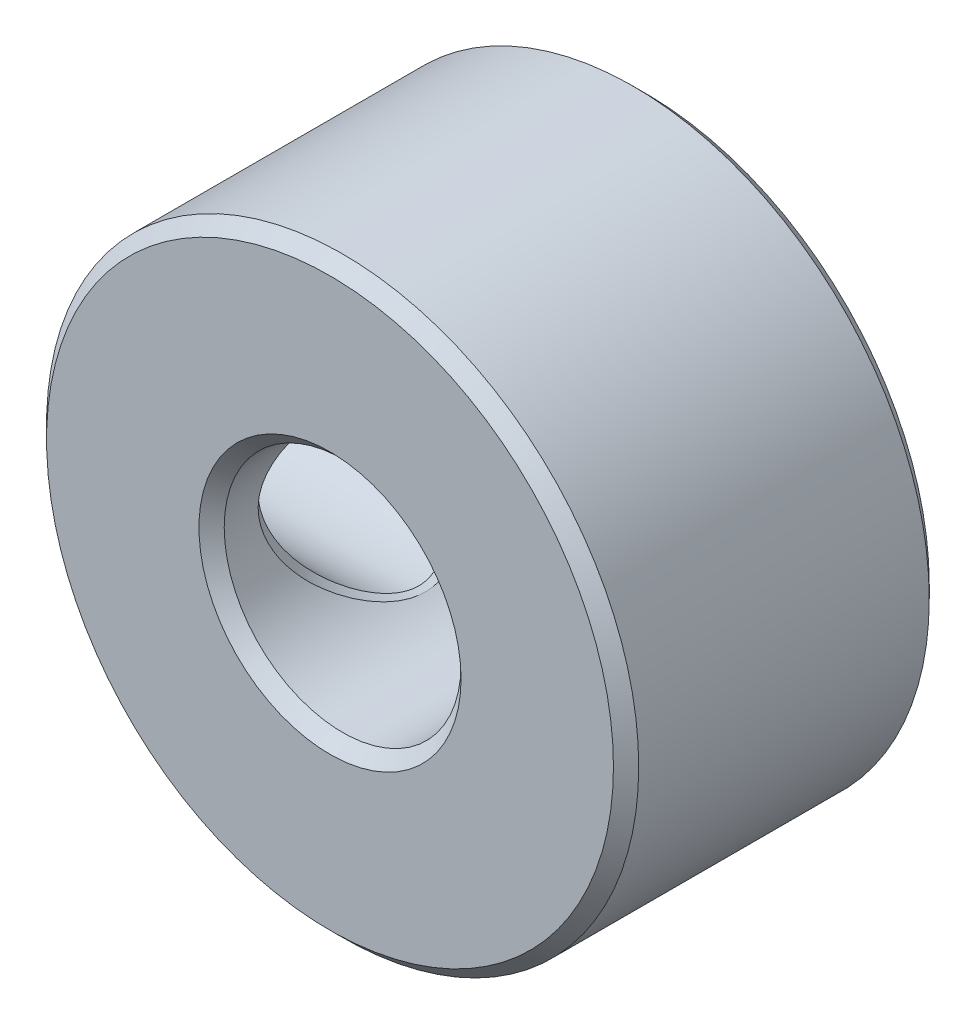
ISO-10303-21;
HEADER;
FILE_DESCRIPTION(('STEP AP214'),'2;1');
FILE_NAME('part.step','',(''),(''),'','','');
FILE_SCHEMA(('AUTOMOTIVE_DESIGN { 1 0 10303 214 1 1 1 1 }'));
ENDSEC;
DATA;
#1=APPLICATION_CONTEXT('core data for automotive mechanical design processes');
#2=APPLICATION_PROTOCOL_DEFINITION('international standard','automotive_design',2000,#1);
#3=PRODUCT_CONTEXT('',#1,'mechanical');
#4=PRODUCT('Part','Part','',(#3));
#5=PRODUCT_RELATED_PRODUCT_CATEGORY('part','',(#4));
#6=PRODUCT_DEFINITION_FORMATION('','',#4);
#7=PRODUCT_DEFINITION_CONTEXT('part definition',#1,'design');
#8=PRODUCT_DEFINITION('design','',#6,#7);
#9=PRODUCT_DEFINITION_SHAPE('','',#8);
#10=(LENGTH_UNIT() NAMED_UNIT(*) SI_UNIT(.MILLI.,.METRE.));
#11=(NAMED_UNIT(*) PLANE_ANGLE_UNIT() SI_UNIT($,.RADIAN.));
#12=(NAMED_UNIT(*) SI_UNIT($,.STERADIAN.) SOLID_ANGLE_UNIT());
#13=UNCERTAINTY_MEASURE_WITH_UNIT(LENGTH_MEASURE(1.E-05),#10,'distance_accuracy_value','');
#14=(GEOMETRIC_REPRESENTATION_CONTEXT(3) GLOBAL_UNCERTAINTY_ASSIGNED_CONTEXT((#13)) GLOBAL_UNIT_ASSIGNED_CONTEXT((#10,
#11,#12)) REPRESENTATION_CONTEXT('',''));
#15=CARTESIAN_POINT('',(0.,0.,0.));
#16=DIRECTION('',(0.,0.,1.));
#17=DIRECTION('',(1.,0.,0.));
#18=AXIS2_PLACEMENT_3D('',#15,#16,#17);
#19=CARTESIAN_POINT('',(0.,0.,3.175));
#20=DIRECTION('',(0.,0.,1.));
#21=DIRECTION('',(1.,0.,0.));
#22=AXIS2_PLACEMENT_3D('',#19,#20,#21);
#23=PLANE('',#22);
#24=CARTESIAN_POINT('',(0.,0.,3.175));
#25=DIRECTION('',(0.,0.,1.));
#26=DIRECTION('',(1.,0.,0.));
#27=AXIS2_PLACEMENT_3D('',#24,#25,#26);
#28=CIRCLE('',#27,5.699125);
#29=CARTESIAN_POINT('',(5.699125,0.,3.175));
#30=VERTEX_POINT('',#29);
#31=EDGE_CURVE('E91',#30,#30,#28,.T.);
#32=ORIENTED_EDGE('',*,*,#31,.T.);
#33=EDGE_LOOP('',(#32));
#34=FACE_BOUND('',#33,.T.);
#35=CARTESIAN_POINT('',(0.,0.,3.175));
#36=DIRECTION('',(0.,0.,1.));
#37=DIRECTION('',(1.,0.,0.));
#38=AXIS2_PLACEMENT_3D('',#35,#36,#37);
#39=CIRCLE('',#38,2.63525);
#40=CARTESIAN_POINT('',(2.63525,0.,3.175));
#41=VERTEX_POINT('',#40);
#42=EDGE_CURVE('E94',#41,#41,#39,.F.);
#43=ORIENTED_EDGE('',*,*,#42,.T.);
#44=EDGE_LOOP('',(#43));
#45=FACE_BOUND('',#44,.T.);
#46=ADVANCED_FACE('F30',(#34,#45),#23,.T.);
#47=CARTESIAN_POINT('',(0.,0.,-3.175));
#48=DIRECTION('',(0.,0.,1.));
#49=DIRECTION('',(1.,0.,0.));
#50=AXIS2_PLACEMENT_3D('',#47,#48,#49);
#51=PLANE('',#50);
#52=CARTESIAN_POINT('',(0.,0.,-3.175));
#53=DIRECTION('',(0.,0.,1.));
#54=DIRECTION('',(1.,0.,0.));
#55=AXIS2_PLACEMENT_3D('',#52,#53,#54);
#56=CIRCLE('',#55,5.699125);
#57=CARTESIAN_POINT('',(5.699125,0.,-3.175));
#58=VERTEX_POINT('',#57);
#59=EDGE_CURVE('E97',#58,#58,#56,.F.);
#60=ORIENTED_EDGE('',*,*,#59,.T.);
#61=EDGE_LOOP('',(#60));
#62=FACE_BOUND('',#61,.T.);
#63=CARTESIAN_POINT('',(0.,0.,-3.175));
#64=DIRECTION('',(0.,0.,1.));
#65=DIRECTION('',(1.,0.,0.));
#66=AXIS2_PLACEMENT_3D('',#63,#64,#65);
#67=CIRCLE('',#66,2.63525);
#68=CARTESIAN_POINT('',(2.63525,0.,-3.175));
#69=VERTEX_POINT('',#68);
#70=EDGE_CURVE('E100',#69,#69,#67,.T.);
#71=ORIENTED_EDGE('',*,*,#70,.T.);
#72=EDGE_LOOP('',(#71));
#73=FACE_BOUND('',#72,.T.);
#74=ADVANCED_FACE('F78',(#62,#73),#51,.F.);
#75=CARTESIAN_POINT('',(0.,0.,3.175));
#76=DIRECTION('',(0.,0.,-1.));
#77=DIRECTION('',(-1.,0.,0.));
#78=AXIS2_PLACEMENT_3D('',#75,#76,#77);
#79=CYLINDRICAL_SURFACE('',#78,5.953125);
#80=CARTESIAN_POINT('',(0.,0.,-2.921));
#81=DIRECTION('',(0.,0.,1.));
#82=DIRECTION('',(1.,0.,0.));
#83=AXIS2_PLACEMENT_3D('',#80,#81,#82);
#84=CIRCLE('',#83,5.953125);
#85=CARTESIAN_POINT('',(5.953125,0.,-2.921));
#86=VERTEX_POINT('',#85);
#87=EDGE_CURVE('E103',#86,#86,#84,.T.);
#88=ORIENTED_EDGE('',*,*,#87,.T.);
#89=EDGE_LOOP('',(#88));
#90=FACE_BOUND('',#89,.T.);
#91=CARTESIAN_POINT('',(0.,0.,2.921));
#92=DIRECTION('',(0.,0.,1.));
#93=DIRECTION('',(1.,0.,0.));
#94=AXIS2_PLACEMENT_3D('',#91,#92,#93);
#95=CIRCLE('',#94,5.953125);
#96=CARTESIAN_POINT('',(5.953125,0.,2.921));
#97=VERTEX_POINT('',#96);
#98=EDGE_CURVE('E106',#97,#97,#95,.F.);
#99=ORIENTED_EDGE('',*,*,#98,.T.);
#100=EDGE_LOOP('',(#99));
#101=FACE_BOUND('',#100,.T.);
#102=CARTESIAN_POINT('',(-5.953125,0.,2.2383749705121));
#103=CARTESIAN_POINT('',(-5.95311577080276,0.0387457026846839,2.23834722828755));
#104=CARTESIAN_POINT('',(-5.95268471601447,0.07748844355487,2.23736117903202));
#105=CARTESIAN_POINT('',(-5.95102066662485,0.154766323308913,2.23350635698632));
#106=CARTESIAN_POINT('',(-5.94978967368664,0.193301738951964,2.230642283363));
#107=CARTESIAN_POINT('',(-5.94657001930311,0.270085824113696,2.22307193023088));
#108=CARTESIAN_POINT('',(-5.94458277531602,0.308334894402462,2.21836909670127));
#109=CARTESIAN_POINT('',(-5.93989543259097,0.384468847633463,2.20716284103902));
#110=CARTESIAN_POINT('',(-5.9371963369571,0.422354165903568,2.20066195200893));
#111=CARTESIAN_POINT('',(-5.93112974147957,0.497682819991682,2.1859004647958));
#112=CARTESIAN_POINT('',(-5.92776297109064,0.535126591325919,2.17764178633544));
#113=CARTESIAN_POINT('',(-5.92040539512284,0.609494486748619,2.1594054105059));
#114=CARTESIAN_POINT('',(-5.91641515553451,0.646419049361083,2.14942927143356));
#115=CARTESIAN_POINT('',(-5.90785489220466,0.719670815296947,2.12779838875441));
#116=CARTESIAN_POINT('',(-5.9032853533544,0.75599848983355,2.11614504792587));
#117=CARTESIAN_POINT('',(-5.89361066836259,0.827978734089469,2.0911999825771));
#118=CARTESIAN_POINT('',(-5.8885059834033,0.863631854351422,2.07790966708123));
#119=CARTESIAN_POINT('',(-5.87780513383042,0.934185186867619,2.04973071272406));
#120=CARTESIAN_POINT('',(-5.87220944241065,0.969086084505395,2.0348436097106));
#121=CARTESIAN_POINT('',(-5.8605706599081,1.03805710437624,2.00351102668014));
#122=CARTESIAN_POINT('',(-5.85452807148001,1.07212810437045,1.98706729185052));
#123=CARTESIAN_POINT('',(-5.84203962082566,1.13936140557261,1.9526613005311));
#124=CARTESIAN_POINT('',(-5.8355942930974,1.17252483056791,1.93470104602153));
#125=CARTESIAN_POINT('',(-5.82234426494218,1.23786497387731,1.89730186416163));
#126=CARTESIAN_POINT('',(-5.81554012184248,1.27004310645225,1.87786521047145));
#127=CARTESIAN_POINT('',(-5.80161721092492,1.33333471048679,1.83755291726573));
#128=CARTESIAN_POINT('',(-5.79449900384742,1.36444991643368,1.81667980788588));
#129=CARTESIAN_POINT('',(-5.77998961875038,1.42553730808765,1.77353485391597));
#130=CARTESIAN_POINT('',(-5.77259898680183,1.45551155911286,1.75126575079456));
#131=CARTESIAN_POINT('',(-5.75759801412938,1.51424006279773,1.70536706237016));
#132=CARTESIAN_POINT('',(-5.74998815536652,1.54299669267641,1.68174036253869));
#133=CARTESIAN_POINT('',(-5.73455891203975,1.59920781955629,1.63317239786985));
#134=CARTESIAN_POINT('',(-5.72674000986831,1.62666496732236,1.60823404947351));
#135=CARTESIAN_POINT('',(-5.71106168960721,1.68021961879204,1.55705546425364));
#136=CARTESIAN_POINT('',(-5.70320237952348,1.70631965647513,1.5308178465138));
#137=CARTESIAN_POINT('',(-5.68762273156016,1.75713914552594,1.47708878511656));
#138=CARTESIAN_POINT('',(-5.67990217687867,1.78186090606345,1.44959958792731));
#139=CARTESIAN_POINT('',(-5.66462061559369,1.82987777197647,1.39344813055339));
#140=CARTESIAN_POINT('',(-5.65705934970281,1.85317533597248,1.36478804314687));
#141=CARTESIAN_POINT('',(-5.64215983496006,1.89830278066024,1.30636793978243));
#142=CARTESIAN_POINT('',(-5.63482119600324,1.92013532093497,1.27661007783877));
#143=CARTESIAN_POINT('',(-5.62041896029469,1.96229025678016,1.21606954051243));
#144=CARTESIAN_POINT('',(-5.61335484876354,1.98261555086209,1.18528900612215));
#145=CARTESIAN_POINT('',(-5.59955677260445,2.02171386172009,1.12277769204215));
#146=CARTESIAN_POINT('',(-5.59282215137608,2.04049002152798,1.09104902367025));
#147=CARTESIAN_POINT('',(-5.57973735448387,2.07644782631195,1.02671617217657));
#148=CARTESIAN_POINT('',(-5.57338637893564,2.09363283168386,0.994114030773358));
#149=CARTESIAN_POINT('',(-5.56112339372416,2.12636614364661,0.928108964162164));
#150=CARTESIAN_POINT('',(-5.5552104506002,2.14191796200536,0.894707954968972));
#151=CARTESIAN_POINT('',(-5.54387798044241,2.17134277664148,0.827179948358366));
#152=CARTESIAN_POINT('',(-5.53845741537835,2.18521932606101,0.793054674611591));
#153=CARTESIAN_POINT('',(-5.52816413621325,2.21125159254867,0.724152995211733));
#154=CARTESIAN_POINT('',(-5.52329033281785,2.22341074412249,0.689378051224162));
#155=CARTESIAN_POINT('',(-5.51414494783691,2.24596637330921,0.619251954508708));
#156=CARTESIAN_POINT('',(-5.50987230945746,2.25636595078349,0.58390193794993));
#157=CARTESIAN_POINT('',(-5.50198354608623,2.27536079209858,0.512700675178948));
#158=CARTESIAN_POINT('',(-5.49836651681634,2.28395854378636,0.476850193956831));
#159=CARTESIAN_POINT('',(-5.49184310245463,2.29930845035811,0.404723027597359));
#160=CARTESIAN_POINT('',(-5.488936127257,2.30606213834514,0.368446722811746));
#161=CARTESIAN_POINT('',(-5.48388690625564,2.31768271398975,0.295542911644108));
#162=CARTESIAN_POINT('',(-5.48174459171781,2.32254977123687,0.258915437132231));
#163=CARTESIAN_POINT('',(-5.47827809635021,2.3303573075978,0.18538434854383));
#164=CARTESIAN_POINT('',(-5.47695462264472,2.33329612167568,0.148480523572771));
#165=CARTESIAN_POINT('',(-5.47518068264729,2.33720410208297,0.0744712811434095));
#166=CARTESIAN_POINT('',(-5.47473200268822,2.33816923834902,0.0373656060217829));
#167=CARTESIAN_POINT('',(-5.4747556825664,2.33810155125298,-0.0368402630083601));
#168=CARTESIAN_POINT('',(-5.4752279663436,2.33706889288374,-0.0739404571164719));
#169=CARTESIAN_POINT('',(-5.4770398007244,2.33304670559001,-0.147930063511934));
#170=CARTESIAN_POINT('',(-5.47837743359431,2.33006150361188,-0.184819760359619));
#171=CARTESIAN_POINT('',(-5.48186647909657,2.32217477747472,-0.258315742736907));
#172=CARTESIAN_POINT('',(-5.4840170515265,2.31727523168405,-0.294922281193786));
#173=CARTESIAN_POINT('',(-5.48907710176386,2.30560356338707,-0.367779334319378));
#174=CARTESIAN_POINT('',(-5.49198652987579,2.29883156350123,-0.404029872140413));
#175=CARTESIAN_POINT('',(-5.49851015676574,2.28345723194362,-0.476102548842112));
#176=CARTESIAN_POINT('',(-5.50212484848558,2.27485361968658,-0.511924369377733));
#177=CARTESIAN_POINT('',(-5.51000498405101,2.25585812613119,-0.583067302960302));
#178=CARTESIAN_POINT('',(-5.51427126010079,2.24546395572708,-0.618387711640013));
#179=CARTESIAN_POINT('',(-5.52340077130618,2.22292894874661,-0.688455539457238));
#180=CARTESIAN_POINT('',(-5.52826501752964,2.21078514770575,-0.723201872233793));
#181=CARTESIAN_POINT('',(-5.53853681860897,2.18479217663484,-0.792049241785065));
#182=CARTESIAN_POINT('',(-5.54394544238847,2.17093963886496,-0.826148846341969));
#183=CARTESIAN_POINT('',(-5.55525245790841,2.14157022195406,-0.893630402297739));
#184=CARTESIAN_POINT('',(-5.56115189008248,2.12604978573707,-0.92701063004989));
#185=CARTESIAN_POINT('',(-5.57338707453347,2.09338539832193,-0.992981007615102));
#186=CARTESIAN_POINT('',(-5.57972378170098,2.07623786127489,-1.02556920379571));
#187=CARTESIAN_POINT('',(-5.59278006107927,2.04035993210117,-1.0898830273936));
#188=CARTESIAN_POINT('',(-5.5995004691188,2.02162603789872,-1.12160653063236));
#189=CARTESIAN_POINT('',(-5.61327093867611,1.98261599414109,-1.18411839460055));
#190=CARTESIAN_POINT('',(-5.62032170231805,1.96233649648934,-1.21490451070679));
#191=CARTESIAN_POINT('',(-5.63469887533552,1.92027560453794,-1.27546903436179));
#192=CARTESIAN_POINT('',(-5.64202584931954,1.89849104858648,-1.30524511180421));
#193=CARTESIAN_POINT('',(-5.65690445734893,1.85346102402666,-1.36371671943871));
#194=CARTESIAN_POINT('',(-5.66445653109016,1.83021258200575,-1.39240984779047));
#195=CARTESIAN_POINT('',(-5.67972302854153,1.78229331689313,-1.44864358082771));
#196=CARTESIAN_POINT('',(-5.68743775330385,1.75761967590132,-1.47618170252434));
#197=CARTESIAN_POINT('',(-5.70300959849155,1.70689775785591,-1.53003016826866));
#198=CARTESIAN_POINT('',(-5.71086697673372,1.68084678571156,-1.55633789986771));
#199=CARTESIAN_POINT('',(-5.72654556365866,1.62738363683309,-1.60766266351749));
#200=CARTESIAN_POINT('',(-5.73436666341,1.59996874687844,-1.63267690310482));
#201=CARTESIAN_POINT('',(-5.74980322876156,1.5438291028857,-1.68138459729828));
#202=CARTESIAN_POINT('',(-5.75741822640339,1.51510171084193,-1.70507515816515));
#203=CARTESIAN_POINT('',(-5.7724316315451,1.45642235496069,-1.75109326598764));
#204=CARTESIAN_POINT('',(-5.77982956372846,1.42646800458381,-1.77341792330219));
#205=CARTESIAN_POINT('',(-5.79435523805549,1.36541079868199,-1.81666505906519));
#206=CARTESIAN_POINT('',(-5.80148243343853,1.33430584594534,-1.83758475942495));
#207=CARTESIAN_POINT('',(-5.81542446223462,1.2710259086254,-1.87798185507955));
#208=CARTESIAN_POINT('',(-5.82223872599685,1.23884914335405,-1.89745665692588));
#209=CARTESIAN_POINT('',(-5.83550961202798,1.17350337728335,-1.93492398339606));
#210=CARTESIAN_POINT('',(-5.84196565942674,1.14033290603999,-1.95291414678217));
#211=CARTESIAN_POINT('',(-5.8544756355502,1.07307771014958,-1.98737211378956));
#212=CARTESIAN_POINT('',(-5.86052900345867,1.03899179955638,-2.00383780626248));
#213=CARTESIAN_POINT('',(-5.87218890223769,0.969983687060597,-2.03520674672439));
#214=CARTESIAN_POINT('',(-5.87779489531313,0.93506054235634,-2.0501081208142));
#215=CARTESIAN_POINT('',(-5.8885153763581,0.86445597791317,-2.07830834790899));
#216=CARTESIAN_POINT('',(-5.89362934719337,0.828773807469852,-2.09160551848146));
#217=CARTESIAN_POINT('',(-5.90332110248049,0.75672925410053,-2.11655730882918));
#218=CARTESIAN_POINT('',(-5.90789837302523,0.720366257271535,-2.12821035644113));
#219=CARTESIAN_POINT('',(-5.9164720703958,0.647038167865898,-2.14983395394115));
#220=CARTESIAN_POINT('',(-5.9204679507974,0.610072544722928,-2.15980292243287));
#221=CARTESIAN_POINT('',(-5.92783424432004,0.535617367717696,-2.17801853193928));
#222=CARTESIAN_POINT('',(-5.9312040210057,0.498127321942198,-2.18626342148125));
#223=CARTESIAN_POINT('',(-5.9372735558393,0.42270151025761,-2.20099122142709));
#224=CARTESIAN_POINT('',(-5.93997250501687,0.384765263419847,-2.20747200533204));
#225=CARTESIAN_POINT('',(-5.94465587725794,0.308525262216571,-2.21863209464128));
#226=CARTESIAN_POINT('',(-5.94663920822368,0.270221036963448,-2.22330864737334));
#227=CARTESIAN_POINT('',(-5.94984711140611,0.193323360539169,-2.23082123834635));
#228=CARTESIAN_POINT('',(-5.95107016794,0.154729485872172,-2.23365360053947));
#229=CARTESIAN_POINT('',(-5.95271283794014,0.0773304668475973,-2.23743829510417));
#230=CARTESIAN_POINT('',(-5.95313033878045,0.0385250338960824,-2.23838568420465));
#231=CARTESIAN_POINT('',(-5.95311964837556,-0.0390827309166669,-2.23836422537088));
#232=CARTESIAN_POINT('',(-5.9526915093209,-0.0778850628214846,-2.23739549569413));
#233=CARTESIAN_POINT('',(-5.95103078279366,-0.155272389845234,-2.23357247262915));
#234=CARTESIAN_POINT('',(-5.94980039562,-0.193857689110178,-2.23072333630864));
#235=CARTESIAN_POINT('',(-5.94657990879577,-0.270733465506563,-2.22318031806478));
#236=CARTESIAN_POINT('',(-5.9445914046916,-0.309024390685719,-2.21849030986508));
#237=CARTESIAN_POINT('',(-5.93989980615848,-0.385233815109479,-2.20730673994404));
#238=CARTESIAN_POINT('',(-5.93719787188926,-0.423152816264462,-2.20081610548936));
#239=CARTESIAN_POINT('',(-5.93112421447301,-0.498540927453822,-2.18607193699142));
#240=CARTESIAN_POINT('',(-5.92775335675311,-0.536010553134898,-2.17782067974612));
#241=CARTESIAN_POINT('',(-5.92038656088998,-0.610422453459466,-2.1595956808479));
#242=CARTESIAN_POINT('',(-5.91639130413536,-0.647365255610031,-2.14962381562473));
#243=CARTESIAN_POINT('',(-5.90782030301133,-0.720646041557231,-2.12799775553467));
#244=CARTESIAN_POINT('',(-5.90324513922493,-0.756984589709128,-2.11634524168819));
#245=CARTESIAN_POINT('',(-5.89355884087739,-0.828979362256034,-2.09139784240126));
#246=CARTESIAN_POINT('',(-5.88844824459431,-0.864636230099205,-2.07810460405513));
#247=CARTESIAN_POINT('',(-5.87773554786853,-0.935190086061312,-2.04991555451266));
#248=CARTESIAN_POINT('',(-5.87213398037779,-0.97008784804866,-2.03502147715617));
#249=CARTESIAN_POINT('',(-5.86048375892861,-1.03904587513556,-2.003670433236));
#250=CARTESIAN_POINT('',(-5.85443565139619,-1.07310709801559,-1.98721537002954));
#251=CARTESIAN_POINT('',(-5.8419368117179,-1.1403143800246,-1.95278194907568));
#252=CARTESIAN_POINT('',(-5.83548664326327,-1.17346163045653,-1.93480571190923));
#253=CARTESIAN_POINT('',(-5.82222791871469,-1.23876321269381,-1.89736952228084));
#254=CARTESIAN_POINT('',(-5.81541993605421,-1.27091900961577,-1.87791192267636));
#255=CARTESIAN_POINT('',(-5.80149066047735,-1.33416001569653,-1.83755245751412));
#256=CARTESIAN_POINT('',(-5.79436993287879,-1.36524698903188,-1.8166531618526));
#257=CARTESIAN_POINT('',(-5.7798571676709,-1.4262721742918,-1.77345019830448));
#258=CARTESIAN_POINT('',(-5.77246567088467,-1.45621245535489,-1.75114927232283));
#259=CARTESIAN_POINT('',(-5.75746490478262,-1.51486785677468,-1.70518138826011));
#260=CARTESIAN_POINT('',(-5.74985610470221,-1.54358532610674,-1.68151727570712));
#261=CARTESIAN_POINT('',(-5.73443144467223,-1.59971210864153,-1.63286737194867));
#262=CARTESIAN_POINT('',(-5.72661604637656,-1.62712400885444,-1.60788442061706));
#263=CARTESIAN_POINT('',(-5.71094600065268,-1.6805893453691,-1.55661150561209));
#264=CARTESIAN_POINT('',(-5.70309144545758,-1.70664506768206,-1.53032389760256));
#265=CARTESIAN_POINT('',(-5.68752081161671,-1.75738439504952,-1.47649254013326));
#266=CARTESIAN_POINT('',(-5.67980454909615,-1.78206993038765,-1.44895066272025));
#267=CARTESIAN_POINT('',(-5.66453127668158,-1.83002107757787,-1.39269108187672));
#268=CARTESIAN_POINT('',(-5.65697404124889,-1.85328880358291,-1.36397524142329));
#269=CARTESIAN_POINT('',(-5.64208223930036,-1.89836304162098,-1.30544202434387));
#270=CARTESIAN_POINT('',(-5.63474732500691,-1.92017190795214,-1.27562654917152));
#271=CARTESIAN_POINT('',(-5.62035220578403,-1.96228530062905,-1.2149699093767));
#272=CARTESIAN_POINT('',(-5.61329153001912,-1.98259246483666,-1.18413068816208));
#273=CARTESIAN_POINT('',(-5.59949999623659,-2.02165975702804,-1.12150197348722));
#274=CARTESIAN_POINT('',(-5.59276852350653,-2.04042281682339,-1.08971444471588));
#275=CARTESIAN_POINT('',(-5.5796897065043,-2.07635906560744,-1.02526466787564));
#276=CARTESIAN_POINT('',(-5.57334159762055,-2.09353545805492,-0.992604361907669));
#277=CARTESIAN_POINT('',(-5.56108404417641,-2.1262555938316,-0.926484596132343));
#278=CARTESIAN_POINT('',(-5.55517369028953,-2.14180275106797,-0.893026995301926));
#279=CARTESIAN_POINT('',(-5.54384611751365,-2.17122169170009,-0.825388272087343));
#280=CARTESIAN_POINT('',(-5.5384278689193,-2.18509699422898,-0.791208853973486));
#281=CARTESIAN_POINT('',(-5.52813896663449,-2.21112960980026,-0.722202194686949));
#282=CARTESIAN_POINT('',(-5.52326721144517,-2.22329039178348,-0.687376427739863));
#283=CARTESIAN_POINT('',(-5.51412569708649,-2.24585151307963,-0.617152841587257));
#284=CARTESIAN_POINT('',(-5.50985484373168,-2.25625505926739,-0.581756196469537));
#285=CARTESIAN_POINT('',(-5.5019694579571,-2.27525945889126,-0.510466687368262));
#286=CARTESIAN_POINT('',(-5.49835395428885,-2.28386298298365,-0.474574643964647));
#287=CARTESIAN_POINT('',(-5.49183344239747,-2.29922542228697,-0.402370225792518));
#288=CARTESIAN_POINT('',(-5.48892774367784,-2.30598613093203,-0.366058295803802));
#289=CARTESIAN_POINT('',(-5.48388095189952,-2.31762117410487,-0.293089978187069));
#290=CARTESIAN_POINT('',(-5.48173965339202,-2.32249601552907,-0.256433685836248));
#291=CARTESIAN_POINT('',(-5.47827517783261,-2.33031871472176,-0.18285258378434));
#292=CARTESIAN_POINT('',(-5.47695253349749,-2.33326531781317,-0.145927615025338));
#293=CARTESIAN_POINT('',(-5.47518003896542,-2.33718865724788,-0.0718846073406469));
#294=CARTESIAN_POINT('',(-5.47473176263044,-2.33816184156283,-0.0347663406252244));
#295=CARTESIAN_POINT('',(-5.47475700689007,-2.33810640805,0.0394545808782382));
#296=CARTESIAN_POINT('',(-5.47523018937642,-2.3370785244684,0.0765572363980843));
#297=CARTESIAN_POINT('',(-5.47704533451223,-2.33305966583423,0.150540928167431));
#298=CARTESIAN_POINT('',(-5.47838512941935,-2.33007358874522,0.187422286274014));
#299=CARTESIAN_POINT('',(-5.48187951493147,-2.32218053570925,0.260891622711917));
#300=CARTESIAN_POINT('',(-5.48403306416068,-2.31727601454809,0.297479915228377));
#301=CARTESIAN_POINT('',(-5.48909990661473,-2.30559043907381,0.370291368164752));
#302=CARTESIAN_POINT('',(-5.49201299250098,-2.29880989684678,0.406514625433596));
#303=CARTESIAN_POINT('',(-5.49854451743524,-2.28341540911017,0.47852451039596));
#304=CARTESIAN_POINT('',(-5.50216332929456,-2.2748004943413,0.514310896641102));
#305=CARTESIAN_POINT('',(-5.51005206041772,-2.25578012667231,0.585375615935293));
#306=CARTESIAN_POINT('',(-5.5143227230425,-2.24537262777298,0.620653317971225));
#307=CARTESIAN_POINT('',(-5.52346113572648,-2.2228095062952,0.690629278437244));
#308=CARTESIAN_POINT('',(-5.52832983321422,-2.21065110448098,0.725326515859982));
#309=CARTESIAN_POINT('',(-5.53861044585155,-2.18462827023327,0.794070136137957));
#310=CARTESIAN_POINT('',(-5.54402338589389,-2.17076060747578,0.828115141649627));
#311=CARTESIAN_POINT('',(-5.5553387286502,-2.14136106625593,0.895482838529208));
#312=CARTESIAN_POINT('',(-5.56124214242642,-2.12582572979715,0.928803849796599));
#313=CARTESIAN_POINT('',(-5.57348477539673,-2.09313244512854,0.994652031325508));
#314=CARTESIAN_POINT('',(-5.57982493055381,-2.07597098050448,1.02717728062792));
#315=CARTESIAN_POINT('',(-5.59288738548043,-2.04006686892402,1.0913623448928));
#316=CARTESIAN_POINT('',(-5.59961050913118,-2.02132076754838,1.12302005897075));
#317=CARTESIAN_POINT('',(-5.61338548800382,-1.98228874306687,1.18539837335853));
#318=CARTESIAN_POINT('',(-5.62043803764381,-1.96199950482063,1.2161167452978));
#319=CARTESIAN_POINT('',(-5.63481765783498,-1.91992232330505,1.27654470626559));
#320=CARTESIAN_POINT('',(-5.64214528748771,-1.89813124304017,1.30625197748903));
#321=CARTESIAN_POINT('',(-5.6570238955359,-1.85309209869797,1.3645857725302));
#322=CARTESIAN_POINT('',(-5.66457530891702,-1.82984108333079,1.39320990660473));
#323=CARTESIAN_POINT('',(-5.6798389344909,-1.78192138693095,1.44930639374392));
#324=CARTESIAN_POINT('',(-5.68755144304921,-1.75724991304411,1.476776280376));
#325=CARTESIAN_POINT('',(-5.70311726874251,-1.70653762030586,1.53048968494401));
#326=CARTESIAN_POINT('',(-5.71097083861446,-1.68049413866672,1.55673061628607));
#327=CARTESIAN_POINT('',(-5.72664122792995,-1.62704646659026,1.60793074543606));
#328=CARTESIAN_POINT('',(-5.73445792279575,-1.59963930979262,1.63288688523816));
#329=CARTESIAN_POINT('',(-5.74988646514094,-1.54351123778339,1.68149347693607));
#330=CARTESIAN_POINT('',(-5.75749775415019,-1.51478722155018,1.70514052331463));
#331=CARTESIAN_POINT('',(-5.77250458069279,-1.45611156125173,1.75108477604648));
#332=CARTESIAN_POINT('',(-5.77989956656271,-1.42615717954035,1.77337866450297));
#333=CARTESIAN_POINT('',(-5.79442002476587,-1.36509790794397,1.81657578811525));
#334=CARTESIAN_POINT('',(-5.8015448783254,-1.3339906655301,1.83747590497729));
#335=CARTESIAN_POINT('',(-5.8154827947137,-1.27070515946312,1.87784363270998));
#336=CARTESIAN_POINT('',(-5.82229522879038,-1.23852494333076,1.8973083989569));
#337=CARTESIAN_POINT('',(-5.83556289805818,-1.1731723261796,1.93476374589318));
#338=CARTESIAN_POINT('',(-5.84201751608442,-1.13999835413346,1.95275180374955));
#339=CARTESIAN_POINT('',(-5.85452494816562,-1.07273725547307,1.98721193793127));
#340=CARTESIAN_POINT('',(-5.86057718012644,-1.03864890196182,2.00368183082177));
#341=CARTESIAN_POINT('',(-5.87223498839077,-0.969638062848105,2.03506383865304));
#342=CARTESIAN_POINT('',(-5.87784003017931,-0.93471464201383,2.04997409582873));
#343=CARTESIAN_POINT('',(-5.88855865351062,-0.864112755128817,2.07819504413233));
#344=CARTESIAN_POINT('',(-5.89367174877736,-0.828433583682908,2.09150415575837));
#345=CARTESIAN_POINT('',(-5.90336165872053,-0.756399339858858,2.11648107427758));
#346=CARTESIAN_POINT('',(-5.90793802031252,-0.720043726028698,2.12814749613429));
#347=CARTESIAN_POINT('',(-5.91650966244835,-0.646735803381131,2.1497973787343));
#348=CARTESIAN_POINT('',(-5.92050448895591,-0.609783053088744,2.1597795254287));
#349=CARTESIAN_POINT('',(-5.92786829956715,-0.535360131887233,2.17801933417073));
#350=CARTESIAN_POINT('',(-5.93123677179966,-0.497889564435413,2.18627558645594));
#351=CARTESIAN_POINT('',(-5.93730315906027,-0.422510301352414,2.20102222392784));
#352=CARTESIAN_POINT('',(-5.94000042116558,-0.384601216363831,2.20751089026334));
#353=CARTESIAN_POINT('',(-5.94467981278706,-0.308424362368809,2.2186812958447));
#354=CARTESIAN_POINT('',(-5.94666103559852,-0.270156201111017,2.22336074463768));
#355=CARTESIAN_POINT('',(-5.94986369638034,-0.193340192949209,2.23087152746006));
#356=CARTESIAN_POINT('',(-5.95108382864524,-0.154791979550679,2.23369968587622));
#357=CARTESIAN_POINT('',(-5.95272053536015,-0.0774965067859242,2.23746849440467));
#358=CARTESIAN_POINT('',(-5.95313522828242,-0.0387489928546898,2.23840472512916));
#359=CARTESIAN_POINT('',(-5.953125,0.,2.2383749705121));
#360=B_SPLINE_CURVE_WITH_KNOTS('',3,(#102,#103,#104,#105,#106,#107,#108,#109,#110,#111,#112,
#113,#114,#115,#116,#117,#118,#119,#120,#121,#122,#123,#124,#125,#126,#127,#128,#129,#130,#131,
#132,#133,#134,#135,#136,#137,#138,#139,#140,#141,#142,#143,#144,#145,#146,#147,#148,#149,#150,
#151,#152,#153,#154,#155,#156,#157,#158,#159,#160,#161,#162,#163,#164,#165,#166,#167,#168,#169,
#170,#171,#172,#173,#174,#175,#176,#177,#178,#179,#180,#181,#182,#183,#184,#185,#186,#187,#188,
#189,#190,#191,#192,#193,#194,#195,#196,#197,#198,#199,#200,#201,#202,#203,#204,#205,#206,#207,
#208,#209,#210,#211,#212,#213,#214,#215,#216,#217,#218,#219,#220,#221,#222,#223,#224,#225,#226,
#227,#228,#229,#230,#231,#232,#233,#234,#235,#236,#237,#238,#239,#240,#241,#242,#243,#244,#245,
#246,#247,#248,#249,#250,#251,#252,#253,#254,#255,#256,#257,#258,#259,#260,#261,#262,#263,#264,
#265,#266,#267,#268,#269,#270,#271,#272,#273,#274,#275,#276,#277,#278,#279,#280,#281,#282,#283,
#284,#285,#286,#287,#288,#289,#290,#291,#292,#293,#294,#295,#296,#297,#298,#299,#300,#301,#302,
#303,#304,#305,#306,#307,#308,#309,#310,#311,#312,#313,#314,#315,#316,#317,#318,#319,#320,#321,
#322,#323,#324,#325,#326,#327,#328,#329,#330,#331,#332,#333,#334,#335,#336,#337,#338,#339,#340,
#341,#342,#343,#344,#345,#346,#347,#348,#349,#350,#351,#352,#353,#354,#355,#356,#357,#358,#359),
.UNSPECIFIED.,.F.,.F.,(4,2,2,2,2,2,2,2,2,2,2,2,2,2,2,2,2,2,2,2,2,2,2,2,2,2,2,2,2,2,2,2,2,2,2,2,
2,2,2,2,2,2,2,2,2,2,2,2,2,2,2,2,2,2,2,2,2,2,2,2,2,2,2,2,2,2,2,2,2,2,2,2,2,2,2,2,2,2,2,2,2,2,2,2,
2,2,2,2,2,2,2,2,2,2,2,2,2,2,2,2,2,2,2,2,2,2,2,2,2,2,2,2,2,2,2,2,2,2,2,2,2,2,2,2,2,2,2,2,4),(0.,
0.116219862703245,0.232150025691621,0.347863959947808,0.463415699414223,0.578841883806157,
0.694163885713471,0.80938998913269,0.924517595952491,1.0395354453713,1.15442583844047,
1.26916686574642,1.38373464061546,1.49810554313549,1.61225848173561,1.7261771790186,
1.83985248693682,1.95330730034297,2.06656593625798,2.1796231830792,2.2924693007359,
2.40509245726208,2.51748118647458,2.62962687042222,2.74152625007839,2.8531839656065,
2.96461512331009,3.07584787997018,3.18692602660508,3.29791154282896,3.40888708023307,
3.51995831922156,3.63125612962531,3.74254474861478,3.85358757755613,3.96451595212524,
4.07543706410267,4.18643598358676,4.29757787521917,4.40891034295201,4.52046585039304,
4.63226417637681,4.7443148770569,4.85661973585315,4.96917519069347,5.08197473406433,
5.19501128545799,5.30827953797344,5.42177828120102,5.53551261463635,5.64948657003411,
5.76369385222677,5.87812068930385,5.99274817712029,6.10755459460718,6.22251769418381,
6.33761697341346,6.45283593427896,6.56816433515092,6.68360043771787,6.79915324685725,
6.91484473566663,7.03071204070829,7.1468096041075,7.26321122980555,7.37960567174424,
7.49568221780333,7.61151580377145,7.72716217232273,7.84265988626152,7.95803242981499,
8.0732903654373,8.18843352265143,8.3034532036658,8.41833439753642,8.53305800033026,
8.64760304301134,8.76194893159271,8.87607770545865,8.9899763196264,9.1036389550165,
9.2171033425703,9.33040360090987,9.44353055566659,9.55647030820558,9.66920671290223,
9.78172387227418,9.89400865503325,10.0060532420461,10.1178577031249,10.2294326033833,
10.3408016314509,10.4520042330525,10.5630982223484,10.6741623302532,10.785298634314,
10.896634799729,11.0079301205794,11.1189481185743,11.2298245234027,11.3406706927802,
11.4515755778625,11.5626078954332,11.6738184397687,11.7852424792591,11.8969021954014,
12.0088091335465,12.1209666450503,12.2333723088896,12.346020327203,12.4589038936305,
12.5720175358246,12.6853594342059,12.7989596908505,12.9128427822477,13.0269946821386,
13.1413939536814,13.2560141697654,13.3708262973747,13.4858010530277,13.6009112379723,
13.7161340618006,13.8314534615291,13.9468624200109,14.0623652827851,14.1779800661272,
14.2937407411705,14.4096994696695,14.525928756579),.UNSPECIFIED.);
#361=CARTESIAN_POINT('',(-5.953125,0.,2.2383749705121));
#362=VERTEX_POINT('',#361);
#363=EDGE_CURVE('E109',#362,#362,#360,.F.);
#364=ORIENTED_EDGE('',*,*,#363,.T.);
#365=EDGE_LOOP('',(#364));
#366=FACE_BOUND('',#365,.T.);
#367=ADVANCED_FACE('F32',(#90,#101,#366),#79,.T.);
#368=CARTESIAN_POINT('',(0.,0.,3.175));
#369=DIRECTION('',(0.,0.,-1.));
#370=DIRECTION('',(-1.,0.,0.));
#371=AXIS2_PLACEMENT_3D('',#368,#369,#370);
#372=CYLINDRICAL_SURFACE('',#371,2.38125);
#373=CARTESIAN_POINT('',(0.,0.,-2.921));
#374=DIRECTION('',(0.,0.,1.));
#375=DIRECTION('',(1.,0.,0.));
#376=AXIS2_PLACEMENT_3D('',#373,#374,#375);
#377=CIRCLE('',#376,2.38125);
#378=CARTESIAN_POINT('',(2.38125,0.,-2.921));
#379=VERTEX_POINT('',#378);
#380=EDGE_CURVE('E45',#379,#379,#377,.F.);
#381=ORIENTED_EDGE('',*,*,#380,.T.);
#382=EDGE_LOOP('',(#381));
#383=FACE_BOUND('',#382,.T.);
#384=CARTESIAN_POINT('',(0.,0.,2.921));
#385=DIRECTION('',(0.,0.,1.));
#386=DIRECTION('',(1.,0.,0.));
#387=AXIS2_PLACEMENT_3D('',#384,#385,#386);
#388=CIRCLE('',#387,2.38125);
#389=CARTESIAN_POINT('',(2.38125,0.,2.921));
#390=VERTEX_POINT('',#389);
#391=EDGE_CURVE('E50',#390,#390,#388,.T.);
#392=ORIENTED_EDGE('',*,*,#391,.T.);
#393=EDGE_LOOP('',(#392));
#394=FACE_BOUND('',#393,.T.);
#395=CARTESIAN_POINT('',(-2.38125,0.,2.23837635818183));
#396=CARTESIAN_POINT('',(-2.38089090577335,-0.576711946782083,2.23787910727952));
#397=CARTESIAN_POINT('',(-2.1532235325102,-1.10266952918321,1.9585953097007));
#398=CARTESIAN_POINT('',(-1.76009609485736,-1.61923647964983,1.36658174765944));
#399=CARTESIAN_POINT('',(-1.61301468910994,-1.75906766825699,1.13893014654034));
#400=CARTESIAN_POINT('',(-1.36158614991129,-1.96022743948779,0.621656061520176));
#401=CARTESIAN_POINT('',(-1.25765444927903,-2.02207212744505,0.322700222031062));
#402=CARTESIAN_POINT('',(-1.25578609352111,-2.02317482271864,-0.313901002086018));
#403=CARTESIAN_POINT('',(-1.35880892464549,-1.96210794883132,-0.614648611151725));
#404=CARTESIAN_POINT('',(-1.61016528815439,-1.76168022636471,-1.13426722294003));
#405=CARTESIAN_POINT('',(-1.75784957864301,-1.62157142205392,-1.36314213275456));
#406=CARTESIAN_POINT('',(-2.15309785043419,-1.10402917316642,-1.95863220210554));
#407=CARTESIAN_POINT('',(-2.38086307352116,-0.581527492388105,-2.23784392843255));
#408=CARTESIAN_POINT('',(-2.3816334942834,0.575809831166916,-2.23890431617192));
#409=CARTESIAN_POINT('',(-2.15420373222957,1.10113343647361,-1.95982161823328));
#410=CARTESIAN_POINT('',(-1.76035108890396,1.61903042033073,-1.36707193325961));
#411=CARTESIAN_POINT('',(-1.61263553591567,1.75947510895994,-1.13822744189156));
#412=CARTESIAN_POINT('',(-1.36162013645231,1.96009602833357,-0.621644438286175));
#413=CARTESIAN_POINT('',(-1.25753842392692,2.0220967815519,-0.320806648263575));
#414=CARTESIAN_POINT('',(-1.25589595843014,2.02315399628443,0.314521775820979));
#415=CARTESIAN_POINT('',(-1.36046088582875,1.96069056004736,0.618123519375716));
#416=CARTESIAN_POINT('',(-1.60968834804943,1.76216046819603,1.13323406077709));
#417=CARTESIAN_POINT('',(-1.75887660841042,1.62052177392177,1.36473719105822));
#418=CARTESIAN_POINT('',(-2.15104036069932,1.10613294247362,1.95543700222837));
#419=CARTESIAN_POINT('',(-2.38160909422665,0.576711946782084,2.23887360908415));
#420=CARTESIAN_POINT('',(-2.38125,0.,2.23837635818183));
#421=B_SPLINE_CURVE_WITH_KNOTS('',3,(#395,#396,#397,#398,#399,#400,#401,#402,#403,#404,#405,
#406,#407,#408,#409,#410,#411,#412,#413,#414,#415,#416,#417,#418,#419,#420),.UNSPECIFIED.,.T.,
.F.,(4,2,2,2,2,2,2,2,2,2,2,2,4),(-0.0146468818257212,-0.0127718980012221,-0.0118344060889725,
-0.0108969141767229,-0.00995942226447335,-0.00902193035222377,-0.00714694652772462,
-0.00527196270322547,-0.0043344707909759,-0.00339697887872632,-0.00245948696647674,
-0.00152199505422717,0.00035298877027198),.UNSPECIFIED.);
#422=CARTESIAN_POINT('',(-2.38125,0.,2.23837635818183));
#423=VERTEX_POINT('',#422);
#424=EDGE_CURVE('E55',#423,#423,#421,.F.);
#425=ORIENTED_EDGE('',*,*,#424,.T.);
#426=EDGE_LOOP('',(#425));
#427=FACE_BOUND('',#426,.T.);
#428=ADVANCED_FACE('F72',(#383,#394,#427),#372,.F.);
#429=CARTESIAN_POINT('',(-6.35,0.,0.));
#430=DIRECTION('',(1.,0.,0.));
#431=DIRECTION('',(0.,0.,-1.));
#432=AXIS2_PLACEMENT_3D('',#429,#430,#431);
#433=CYLINDRICAL_SURFACE('',#432,1.984375);
#434=CARTESIAN_POINT('',(-2.63525241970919,0.,1.984375));
#435=CARTESIAN_POINT('',(-2.63527011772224,0.0235022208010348,1.98439444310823));
#436=CARTESIAN_POINT('',(-2.63484459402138,0.0470038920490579,1.98397742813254));
#437=CARTESIAN_POINT('',(-2.63313391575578,0.0938258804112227,1.98228734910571));
#438=CARTESIAN_POINT('',(-2.63185312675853,0.11714651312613,1.9810186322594));
#439=CARTESIAN_POINT('',(-2.62846425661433,0.163585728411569,1.97764772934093));
#440=CARTESIAN_POINT('',(-2.62635902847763,0.186704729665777,1.97554841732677));
#441=CARTESIAN_POINT('',(-2.62135513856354,0.232721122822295,1.97054037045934));
#442=CARTESIAN_POINT('',(-2.61845805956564,0.255618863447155,1.96763325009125));
#443=CARTESIAN_POINT('',(-2.61190359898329,0.301173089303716,1.96103295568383));
#444=CARTESIAN_POINT('',(-2.60824677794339,0.323829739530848,1.95734036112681));
#445=CARTESIAN_POINT('',(-2.60020584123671,0.368882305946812,1.94919237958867));
#446=CARTESIAN_POINT('',(-2.59582149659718,0.391278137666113,1.9447367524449));
#447=CARTESIAN_POINT('',(-2.5863582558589,0.435789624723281,1.93508571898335));
#448=CARTESIAN_POINT('',(-2.58127855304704,0.457904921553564,1.92988945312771));
#449=CARTESIAN_POINT('',(-2.57045714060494,0.501835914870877,1.91877996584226));
#450=CARTESIAN_POINT('',(-2.56471423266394,0.523650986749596,1.91286544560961));
#451=CARTESIAN_POINT('',(-2.55259877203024,0.566962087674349,1.90034209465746));
#452=CARTESIAN_POINT('',(-2.54622478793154,0.588457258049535,1.89373168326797));
#453=CARTESIAN_POINT('',(-2.53287938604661,0.631109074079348,1.87983904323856));
#454=CARTESIAN_POINT('',(-2.52590643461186,0.652264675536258,1.87255508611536));
#455=CARTESIAN_POINT('',(-2.51139518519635,0.69421781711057,1.85733771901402));
#456=CARTESIAN_POINT('',(-2.50385535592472,0.715014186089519,1.84940254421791));
#457=CARTESIAN_POINT('',(-2.48824234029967,0.756229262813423,1.83290500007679));
#458=CARTESIAN_POINT('',(-2.48016770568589,0.776646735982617,1.82434092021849));
#459=CARTESIAN_POINT('',(-2.46351699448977,0.817084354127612,1.80660773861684));
#460=CARTESIAN_POINT('',(-2.45493961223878,0.837103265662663,1.79743705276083));
#461=CARTESIAN_POINT('',(-2.43731526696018,0.876724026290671,1.77851276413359));
#462=CARTESIAN_POINT('',(-2.42826718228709,0.896324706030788,1.76875775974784));
#463=CARTESIAN_POINT('',(-2.40973325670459,0.935089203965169,1.74868688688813));
#464=CARTESIAN_POINT('',(-2.40024650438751,0.954251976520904,1.73836984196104));
#465=CARTESIAN_POINT('',(-2.38086704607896,0.992120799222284,1.71719690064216));
#466=CARTESIAN_POINT('',(-2.37097365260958,1.01082598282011,1.7063400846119));
#467=CARTESIAN_POINT('',(-2.35081270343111,1.04775971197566,1.68410958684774));
#468=CARTESIAN_POINT('',(-2.34054468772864,1.06598762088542,1.67273526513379));
#469=CARTESIAN_POINT('',(-2.31966628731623,1.10194682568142,1.64949171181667));
#470=CARTESIAN_POINT('',(-2.30905566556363,1.11967776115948,1.63762213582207));
#471=CARTESIAN_POINT('',(-2.28752384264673,1.15462302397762,1.61341004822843));
#472=CARTESIAN_POINT('',(-2.27660261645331,1.17183730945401,1.60106749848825));
#473=CARTESIAN_POINT('',(-2.25448142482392,1.20572913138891,1.57593130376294));
#474=CARTESIAN_POINT('',(-2.24328163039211,1.22240698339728,1.56313793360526));
#475=CARTESIAN_POINT('',(-2.22063501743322,1.2552061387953,1.5371223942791));
#476=CARTESIAN_POINT('',(-2.20918854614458,1.27132815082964,1.52390081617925));
#477=CARTESIAN_POINT('',(-2.18608084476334,1.30299436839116,1.49704943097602));
#478=CARTESIAN_POINT('',(-2.17442011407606,1.31853971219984,1.48342053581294));
#479=CARTESIAN_POINT('',(-2.15091421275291,1.34903658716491,1.45578149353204));
#480=CARTESIAN_POINT('',(-2.13906967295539,1.36398970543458,1.44177256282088));
#481=CARTESIAN_POINT('',(-2.1152338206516,1.39326643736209,1.41337660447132));
#482=CARTESIAN_POINT('',(-2.10324321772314,1.4075921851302,1.39899117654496));
#483=CARTESIAN_POINT('',(-2.06688456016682,1.44989328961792,1.35518529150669));
#484=CARTESIAN_POINT('',(-2.04222615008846,1.47706783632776,1.32522946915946));
#485=CARTESIAN_POINT('',(-1.99221609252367,1.52972381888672,1.26373297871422));
#486=CARTESIAN_POINT('',(-1.96686005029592,1.55518637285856,1.2321798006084));
#487=CARTESIAN_POINT('',(-1.91589803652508,1.60426804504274,1.16751176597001));
#488=CARTESIAN_POINT('',(-1.89029144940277,1.62787723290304,1.13438984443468));
#489=CARTESIAN_POINT('',(-1.83926469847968,1.67313700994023,1.06665869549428));
#490=CARTESIAN_POINT('',(-1.81384464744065,1.69478649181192,1.03204864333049));
#491=CARTESIAN_POINT('',(-1.7636279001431,1.73600508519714,0.961398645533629));
#492=CARTESIAN_POINT('',(-1.73882928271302,1.7555814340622,0.925364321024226));
#493=CARTESIAN_POINT('',(-1.70237001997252,1.78334430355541,0.870182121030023));
#494=CARTESIAN_POINT('',(-1.69036918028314,1.79231118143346,0.851647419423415));
#495=CARTESIAN_POINT('',(-1.66668324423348,1.80968165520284,0.8142510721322));
#496=CARTESIAN_POINT('',(-1.6549969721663,1.81808759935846,0.795391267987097));
#497=CARTESIAN_POINT('',(-1.63197238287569,1.83435519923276,0.757231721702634));
#498=CARTESIAN_POINT('',(-1.6206340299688,1.84221691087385,0.737932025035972));
#499=CARTESIAN_POINT('',(-1.5983797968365,1.85741042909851,0.698794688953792));
#500=CARTESIAN_POINT('',(-1.58746536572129,1.86474048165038,0.678955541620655));
#501=CARTESIAN_POINT('',(-1.56615949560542,1.87884175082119,0.638777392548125));
#502=CARTESIAN_POINT('',(-1.55576853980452,1.88561245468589,0.618437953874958));
#503=CARTESIAN_POINT('',(-1.53562248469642,1.89856355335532,0.577289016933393));
#504=CARTESIAN_POINT('',(-1.52586674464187,1.9047445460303,0.556480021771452));
#505=CARTESIAN_POINT('',(-1.50710085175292,1.91648560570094,0.514423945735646));
#506=CARTESIAN_POINT('',(-1.49808883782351,1.92204723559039,0.49317813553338));
#507=CARTESIAN_POINT('',(-1.48092126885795,1.93251879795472,0.450280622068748));
#508=CARTESIAN_POINT('',(-1.47276266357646,1.93743106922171,0.428630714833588));
#509=CARTESIAN_POINT('',(-1.4574117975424,1.94657377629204,0.384955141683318));
#510=CARTESIAN_POINT('',(-1.45021551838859,1.95080706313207,0.362931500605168));
#511=CARTESIAN_POINT('',(-1.44021907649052,1.95662851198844,0.329607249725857));
#512=CARTESIAN_POINT('',(-1.43702441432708,1.95847836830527,0.318469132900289));
#513=CARTESIAN_POINT('',(-1.4309175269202,1.96199665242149,0.296112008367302));
#514=CARTESIAN_POINT('',(-1.4280047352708,1.96366544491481,0.284893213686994));
#515=CARTESIAN_POINT('',(-1.4224753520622,1.96681783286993,0.262379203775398));
#516=CARTESIAN_POINT('',(-1.41985822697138,1.96830176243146,0.251084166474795));
#517=CARTESIAN_POINT('',(-1.4149337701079,1.97108076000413,0.22842170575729));
#518=CARTESIAN_POINT('',(-1.41262597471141,1.97237611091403,0.217054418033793));
#519=CARTESIAN_POINT('',(-1.40833376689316,1.97477428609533,0.194251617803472));
#520=CARTESIAN_POINT('',(-1.40634900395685,1.97587731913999,0.182816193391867));
#521=CARTESIAN_POINT('',(-1.40271640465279,1.97788721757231,0.159881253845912));
#522=CARTESIAN_POINT('',(-1.40106838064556,1.9787941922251,0.148381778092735));
#523=CARTESIAN_POINT('',(-1.39812272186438,1.98040837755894,0.125322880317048));
#524=CARTESIAN_POINT('',(-1.39682511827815,1.9811155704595,0.113763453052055));
#525=CARTESIAN_POINT('',(-1.39459382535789,1.98232654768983,0.0905887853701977));
#526=CARTESIAN_POINT('',(-1.39366044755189,1.98283015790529,0.0789735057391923));
#527=CARTESIAN_POINT('',(-1.39217061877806,1.98363064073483,0.0556912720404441));
#528=CARTESIAN_POINT('',(-1.39161482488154,1.9839271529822,0.0440242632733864));
#529=CARTESIAN_POINT('',(-1.39089479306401,1.98430907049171,0.0206426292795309));
#530=CARTESIAN_POINT('',(-1.39073163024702,1.98439389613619,0.00892796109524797));
#531=CARTESIAN_POINT('',(-1.39080496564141,1.98435219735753,-0.0144971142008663));
#532=CARTESIAN_POINT('',(-1.39104137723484,1.98422571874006,-0.0262075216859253));
#533=CARTESIAN_POINT('',(-1.3918983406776,1.98376650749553,-0.0495729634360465));
#534=CARTESIAN_POINT('',(-1.39251767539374,1.98343442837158,-0.0612280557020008));
#535=CARTESIAN_POINT('',(-1.39412824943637,1.98256669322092,-0.0844795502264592));
#536=CARTESIAN_POINT('',(-1.39511868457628,1.98203147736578,-0.0960760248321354));
#537=CARTESIAN_POINT('',(-1.39745760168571,1.98076119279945,-0.119206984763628));
#538=CARTESIAN_POINT('',(-1.39880563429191,1.98002637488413,-0.130741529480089));
#539=CARTESIAN_POINT('',(-1.40184640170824,1.97836029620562,-0.153745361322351));
#540=CARTESIAN_POINT('',(-1.40353898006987,1.97742912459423,-0.165214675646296));
#541=CARTESIAN_POINT('',(-1.40725543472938,1.97537379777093,-0.188084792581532));
#542=CARTESIAN_POINT('',(-1.4092793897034,1.97424959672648,-0.199485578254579));
#543=CARTESIAN_POINT('',(-1.41364528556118,1.97181162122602,-0.222215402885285));
#544=CARTESIAN_POINT('',(-1.41598748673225,1.97049769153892,-0.233544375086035));
#545=CARTESIAN_POINT('',(-1.42097659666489,1.96768365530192,-0.256127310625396));
#546=CARTESIAN_POINT('',(-1.42362389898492,1.96618330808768,-0.267381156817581));
#547=CARTESIAN_POINT('',(-1.42921002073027,1.96299978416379,-0.289810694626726));
#548=CARTESIAN_POINT('',(-1.43214932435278,1.96131630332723,-0.300986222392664));
#549=CARTESIAN_POINT('',(-1.43830615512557,1.95776992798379,-0.323255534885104));
#550=CARTESIAN_POINT('',(-1.44152421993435,1.95590668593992,-0.334349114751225));
#551=CARTESIAN_POINT('',(-1.45158734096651,1.95004621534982,-0.367539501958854));
#552=CARTESIAN_POINT('',(-1.45882308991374,1.94578858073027,-0.389473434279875));
#553=CARTESIAN_POINT('',(-1.47424713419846,1.93659728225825,-0.432974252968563));
#554=CARTESIAN_POINT('',(-1.48243966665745,1.9316605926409,-0.454538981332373));
#555=CARTESIAN_POINT('',(-1.49967353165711,1.92113706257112,-0.49727732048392));
#556=CARTESIAN_POINT('',(-1.5087183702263,1.91554751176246,-0.518448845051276));
#557=CARTESIAN_POINT('',(-1.52755262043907,1.90374427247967,-0.560374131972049));
#558=CARTESIAN_POINT('',(-1.537344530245,1.8975284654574,-0.581126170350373));
#559=CARTESIAN_POINT('',(-1.55756997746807,1.88449799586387,-0.622185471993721));
#560=CARTESIAN_POINT('',(-1.56800492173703,1.87768200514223,-0.642491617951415));
#561=CARTESIAN_POINT('',(-1.58941011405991,1.86347771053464,-0.682634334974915));
#562=CARTESIAN_POINT('',(-1.6003807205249,1.85608902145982,-0.702470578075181));
#563=CARTESIAN_POINT('',(-1.62276340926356,1.84076042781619,-0.741638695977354));
#564=CARTESIAN_POINT('',(-1.63417493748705,1.83282120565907,-0.760971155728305));
#565=CARTESIAN_POINT('',(-1.65733762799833,1.81640461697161,-0.799197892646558));
#566=CARTESIAN_POINT('',(-1.66908878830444,1.80792725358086,-0.818092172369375));
#567=CARTESIAN_POINT('',(-1.69287419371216,1.79043955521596,-0.855522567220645));
#568=CARTESIAN_POINT('',(-1.70490904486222,1.78142800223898,-0.874057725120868));
#569=CARTESIAN_POINT('',(-1.74140768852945,1.75357871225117,-0.929158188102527));
#570=CARTESIAN_POINT('',(-1.76620399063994,1.73396972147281,-0.965117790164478));
#571=CARTESIAN_POINT('',(-1.81636300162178,1.69271851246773,-1.035557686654));
#572=CARTESIAN_POINT('',(-1.8417266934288,1.67107251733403,-1.07003505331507));
#573=CARTESIAN_POINT('',(-1.89263082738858,1.62581393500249,-1.13749784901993));
#574=CARTESIAN_POINT('',(-1.91817115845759,1.60220249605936,-1.1704841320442));
#575=CARTESIAN_POINT('',(-1.96903537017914,1.55307224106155,-1.23493568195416));
#576=CARTESIAN_POINT('',(-1.99435968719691,1.52755998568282,-1.26640561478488));
#577=CARTESIAN_POINT('',(-2.04438643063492,1.47472238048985,-1.3278478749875));
#578=CARTESIAN_POINT('',(-2.06909171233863,1.44740906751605,-1.35782818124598));
#579=CARTESIAN_POINT('',(-2.10554210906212,1.40489513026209,-1.40170756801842));
#580=CARTESIAN_POINT('',(-2.11757669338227,1.39048498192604,-1.41613526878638));
#581=CARTESIAN_POINT('',(-2.14148512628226,1.36105872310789,-1.44459876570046));
#582=CARTESIAN_POINT('',(-2.15335850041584,1.34604119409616,-1.45863349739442));
#583=CARTESIAN_POINT('',(-2.17690779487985,1.3154332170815,-1.48630864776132));
#584=CARTESIAN_POINT('',(-2.18858333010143,1.29984180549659,-1.49994832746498));
#585=CARTESIAN_POINT('',(-2.21170755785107,1.26809944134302,-1.52680706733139));
#586=CARTESIAN_POINT('',(-2.2231559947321,1.25194790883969,-1.54002566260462));
#587=CARTESIAN_POINT('',(-2.24579463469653,1.21910400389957,-1.56602235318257));
#588=CARTESIAN_POINT('',(-2.25698473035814,1.20241141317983,-1.5788002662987));
#589=CARTESIAN_POINT('',(-2.27907580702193,1.1685026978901,-1.60389398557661));
#590=CARTESIAN_POINT('',(-2.28997684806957,1.15128668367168,-1.61620988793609));
#591=CARTESIAN_POINT('',(-2.31145877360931,1.11634883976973,-1.64035844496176));
#592=CARTESIAN_POINT('',(-2.32203990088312,1.09862741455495,-1.65219146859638));
#593=CARTESIAN_POINT('',(-2.34285098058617,1.06269639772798,-1.67535300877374));
#594=CARTESIAN_POINT('',(-2.35308136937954,1.04448746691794,-1.68668215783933));
#595=CARTESIAN_POINT('',(-2.37315993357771,1.00759915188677,-1.70881473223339));
#596=CARTESIAN_POINT('',(-2.38300874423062,0.988920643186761,-1.71961903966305));
#597=CARTESIAN_POINT('',(-2.40229311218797,0.951110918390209,-1.740680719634));
#598=CARTESIAN_POINT('',(-2.41172950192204,0.931980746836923,-1.75093920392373));
#599=CARTESIAN_POINT('',(-2.43015799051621,0.893285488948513,-1.77088804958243));
#600=CARTESIAN_POINT('',(-2.43915110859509,0.873721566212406,-1.7805797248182));
#601=CARTESIAN_POINT('',(-2.4566620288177,0.834176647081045,-1.79937379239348));
#602=CARTESIAN_POINT('',(-2.46518101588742,0.814196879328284,-1.80847766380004));
#603=CARTESIAN_POINT('',(-2.4817126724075,0.773838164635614,-1.82607500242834));
#604=CARTESIAN_POINT('',(-2.48972665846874,0.753460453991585,-1.83457006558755));
#605=CARTESIAN_POINT('',(-2.50521734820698,0.712323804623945,-1.85092871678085));
#606=CARTESIAN_POINT('',(-2.51269545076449,0.691566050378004,-1.85879395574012));
#607=CARTESIAN_POINT('',(-2.52708346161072,0.649687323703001,-1.8738719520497));
#608=CARTESIAN_POINT('',(-2.53399478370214,0.628567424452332,-1.88108633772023));
#609=CARTESIAN_POINT('',(-2.54721839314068,0.585982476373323,-1.89484170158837));
#610=CARTESIAN_POINT('',(-2.55353202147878,0.564518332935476,-1.9013841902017));
#611=CARTESIAN_POINT('',(-2.56552949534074,0.521263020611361,-1.91377493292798));
#612=CARTESIAN_POINT('',(-2.57121449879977,0.499472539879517,-1.9196244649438));
#613=CARTESIAN_POINT('',(-2.58192409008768,0.455582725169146,-1.93060858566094));
#614=CARTESIAN_POINT('',(-2.5869495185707,0.433483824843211,-1.93574408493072));
#615=CARTESIAN_POINT('',(-2.59630946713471,0.388995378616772,-1.945279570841));
#616=CARTESIAN_POINT('',(-2.60064435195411,0.366605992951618,-1.9496799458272));
#617=CARTESIAN_POINT('',(-2.60859288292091,0.321554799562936,-1.95772476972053));
#618=CARTESIAN_POINT('',(-2.61220623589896,0.298892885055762,-1.96136891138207));
#619=CARTESIAN_POINT('',(-2.61868156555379,0.253314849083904,-1.96788104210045));
#620=CARTESIAN_POINT('',(-2.62154238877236,0.230398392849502,-1.97074783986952));
#621=CARTESIAN_POINT('',(-2.62648270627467,0.184329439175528,-1.97568520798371));
#622=CARTESIAN_POINT('',(-2.62855996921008,0.161176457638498,-1.97775350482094));
#623=CARTESIAN_POINT('',(-2.63190351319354,0.114652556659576,-1.98107414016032));
#624=CARTESIAN_POINT('',(-2.63316626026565,0.0912811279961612,-1.98232292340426));
#625=CARTESIAN_POINT('',(-2.63485104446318,0.0443382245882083,-1.9839844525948));
#626=CARTESIAN_POINT('',(-2.63526802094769,0.0207663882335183,-1.98439216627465));
#627=CARTESIAN_POINT('',(-2.63523302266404,-0.0263725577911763,-1.98435387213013));
#628=CARTESIAN_POINT('',(-2.63478117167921,-0.0499396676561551,-1.98390798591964));
#629=CARTESIAN_POINT('',(-2.63302827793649,-0.0968642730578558,-1.98217309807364));
#630=CARTESIAN_POINT('',(-2.63173252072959,-0.120222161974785,-1.98088934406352));
#631=CARTESIAN_POINT('',(-2.62832397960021,-0.166710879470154,-1.97750056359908));
#632=CARTESIAN_POINT('',(-2.62621493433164,-0.189842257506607,-1.97539929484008));
#633=CARTESIAN_POINT('',(-2.62121206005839,-0.235860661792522,-1.97039769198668));
#634=CARTESIAN_POINT('',(-2.618320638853,-0.258748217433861,-1.96749980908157));
#635=CARTESIAN_POINT('',(-2.61178495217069,-0.304261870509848,-1.96092684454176));
#636=CARTESIAN_POINT('',(-2.60814198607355,-0.326888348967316,-1.95725310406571));
#637=CARTESIAN_POINT('',(-2.60013494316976,-0.371862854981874,-1.94915012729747));
#638=CARTESIAN_POINT('',(-2.59577127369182,-0.394211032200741,-1.94472131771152));
#639=CARTESIAN_POINT('',(-2.58635433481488,-0.438612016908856,-1.93512969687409));
#640=CARTESIAN_POINT('',(-2.58130078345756,-0.46066469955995,-1.92996658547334));
#641=CARTESIAN_POINT('',(-2.57053539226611,-0.504457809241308,-1.91892767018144));
#642=CARTESIAN_POINT('',(-2.5648227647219,-0.526197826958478,-1.91305101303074));
#643=CARTESIAN_POINT('',(-2.55277035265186,-0.569348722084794,-1.90060614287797));
#644=CARTESIAN_POINT('',(-2.54642943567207,-0.590758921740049,-1.89403667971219));
#645=CARTESIAN_POINT('',(-2.53315142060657,-0.633233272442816,-1.88022718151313));
#646=CARTESIAN_POINT('',(-2.52621298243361,-0.654296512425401,-1.87298563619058));
#647=CARTESIAN_POINT('',(-2.51177076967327,-0.696059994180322,-1.85785282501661));
#648=CARTESIAN_POINT('',(-2.50426556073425,-0.716759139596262,-1.84995990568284));
#649=CARTESIAN_POINT('',(-2.48872054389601,-0.75777742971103,-1.83354508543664));
#650=CARTESIAN_POINT('',(-2.48067929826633,-0.778095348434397,-1.82502148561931));
#651=CARTESIAN_POINT('',(-2.46409286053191,-0.818334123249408,-1.80736595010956));
#652=CARTESIAN_POINT('',(-2.45554629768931,-0.838253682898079,-1.79823235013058));
#653=CARTESIAN_POINT('',(-2.43797981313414,-0.877678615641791,-1.7793773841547));
#654=CARTESIAN_POINT('',(-2.42895863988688,-0.897182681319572,-1.76965445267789));
#655=CARTESIAN_POINT('',(-2.41047347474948,-0.935759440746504,-1.74964133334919));
#656=CARTESIAN_POINT('',(-2.40100838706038,-0.954830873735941,-1.73934972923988));
#657=CARTESIAN_POINT('',(-2.38166590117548,-0.992525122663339,-1.7182197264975));
#658=CARTESIAN_POINT('',(-2.37178758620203,-1.01114677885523,-1.70738009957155));
#659=CARTESIAN_POINT('',(-2.35164913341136,-1.04792417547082,-1.68517447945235));
#660=CARTESIAN_POINT('',(-2.3413882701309,-1.06607890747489,-1.67380747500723));
#661=CARTESIAN_POINT('',(-2.3205152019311,-1.10190509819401,-1.6505674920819));
#662=CARTESIAN_POINT('',(-2.30990246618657,-1.11957574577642,-1.63869374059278));
#663=CARTESIAN_POINT('',(-2.28835612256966,-1.15441639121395,-1.61446067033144));
#664=CARTESIAN_POINT('',(-2.27742217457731,-1.17158581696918,-1.60210083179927));
#665=CARTESIAN_POINT('',(-2.25526392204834,-1.2054064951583,-1.57691585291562));
#666=CARTESIAN_POINT('',(-2.24403945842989,-1.22205745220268,-1.56409045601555));
#667=CARTESIAN_POINT('',(-2.22133055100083,-1.25482402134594,-1.53799509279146));
#668=CARTESIAN_POINT('',(-2.20984611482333,-1.27093964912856,-1.52472513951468));
#669=CARTESIAN_POINT('',(-2.18664821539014,-1.30261689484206,-1.49775961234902));
#670=CARTESIAN_POINT('',(-2.17493490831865,-1.31817887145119,-1.48406432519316));
#671=CARTESIAN_POINT('',(-2.15130814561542,-1.34873555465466,-1.45627370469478));
#672=CARTESIAN_POINT('',(-2.13939497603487,-1.36373098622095,-1.44217892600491));
#673=CARTESIAN_POINT('',(-2.11540518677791,-1.39312103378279,-1.41359020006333));
#674=CARTESIAN_POINT('',(-2.10332894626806,-1.40751680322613,-1.39909711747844));
#675=CARTESIAN_POINT('',(-2.06676154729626,-1.4499876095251,-1.35503169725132));
#676=CARTESIAN_POINT('',(-2.04198500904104,-1.4772775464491,-1.32493633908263));
#677=CARTESIAN_POINT('',(-1.99183787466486,-1.53005978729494,-1.26328751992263));
#678=CARTESIAN_POINT('',(-1.96646474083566,-1.55554124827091,-1.23172687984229));
#679=CARTESIAN_POINT('',(-1.91551898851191,-1.60460536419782,-1.16709745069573));
#680=CARTESIAN_POINT('',(-1.88994599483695,-1.62818185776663,-1.13402427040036));
#681=CARTESIAN_POINT('',(-1.83898543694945,-1.67337117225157,-1.06637261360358));
#682=CARTESIAN_POINT('',(-1.81359803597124,-1.69498242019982,-1.03179296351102));
#683=CARTESIAN_POINT('',(-1.76339336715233,-1.73616959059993,-0.961114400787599));
#684=CARTESIAN_POINT('',(-1.73857543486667,-1.75574799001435,-0.925017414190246));
#685=CARTESIAN_POINT('',(-1.70205092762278,-1.78355099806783,-0.869688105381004));
#686=CARTESIAN_POINT('',(-1.69000392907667,-1.79255033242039,-0.851065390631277));
#687=CARTESIAN_POINT('',(-1.66619196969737,-1.81001646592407,-0.813444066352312));
#688=CARTESIAN_POINT('',(-1.65442656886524,-1.81848413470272,-0.794446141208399));
#689=CARTESIAN_POINT('',(-1.63124303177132,-1.83487765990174,-0.75601318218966));
#690=CARTESIAN_POINT('',(-1.61982484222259,-1.84280359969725,-0.736578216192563));
#691=CARTESIAN_POINT('',(-1.59744737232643,-1.85809460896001,-0.697222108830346));
#692=CARTESIAN_POINT('',(-1.58648819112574,-1.86545955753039,-0.677300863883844));
#693=CARTESIAN_POINT('',(-1.5651238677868,-1.87960594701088,-0.637002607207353));
#694=CARTESIAN_POINT('',(-1.55471789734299,-1.88638827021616,-0.616626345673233));
#695=CARTESIAN_POINT('',(-1.53456771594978,-1.89934189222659,-0.575438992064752));
#696=CARTESIAN_POINT('',(-1.5248216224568,-1.9055149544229,-0.554629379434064));
#697=CARTESIAN_POINT('',(-1.50609564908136,-1.91722401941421,-0.512598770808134));
#698=CARTESIAN_POINT('',(-1.49711282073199,-1.92276250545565,-0.49137978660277));
#699=CARTESIAN_POINT('',(-1.48001890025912,-1.93317608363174,-0.448554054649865));
#700=CARTESIAN_POINT('',(-1.47190391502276,-1.93805416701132,-0.426949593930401));
#701=CARTESIAN_POINT('',(-1.45665013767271,-1.9471212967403,-0.383374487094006));
#702=CARTESIAN_POINT('',(-1.44950683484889,-1.95131354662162,-0.361406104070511));
#703=CARTESIAN_POINT('',(-1.43959329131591,-1.9570712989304,-0.328166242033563));
#704=CARTESIAN_POINT('',(-1.43642687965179,-1.95889954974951,-0.317056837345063));
#705=CARTESIAN_POINT('',(-1.4303768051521,-1.96237456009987,-0.294756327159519));
#706=CARTESIAN_POINT('',(-1.42749260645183,-1.96402166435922,-0.283565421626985));
#707=CARTESIAN_POINT('',(-1.42202004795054,-1.9671311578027,-0.261105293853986));
#708=CARTESIAN_POINT('',(-1.4194312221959,-1.96859383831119,-0.249836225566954));
#709=CARTESIAN_POINT('',(-1.41456231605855,-1.97133137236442,-0.227222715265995));
#710=CARTESIAN_POINT('',(-1.41228187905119,-1.97260644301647,-0.215878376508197));
#711=CARTESIAN_POINT('',(-1.40804265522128,-1.97496564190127,-0.193117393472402));
#712=CARTESIAN_POINT('',(-1.40608366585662,-1.97604989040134,-0.18170079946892));
#713=CARTESIAN_POINT('',(-1.40250018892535,-1.97802435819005,-0.158798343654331));
#714=CARTESIAN_POINT('',(-1.40087570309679,-1.97891457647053,-0.147312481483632));
#715=CARTESIAN_POINT('',(-1.39797402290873,-1.9804979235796,-0.124274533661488));
#716=CARTESIAN_POINT('',(-1.39669708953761,-1.98119090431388,-0.112722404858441));
#717=CARTESIAN_POINT('',(-1.39450329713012,-1.98237672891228,-0.0895549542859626));
#718=CARTESIAN_POINT('',(-1.39358701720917,-1.98286925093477,-0.0779395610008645));
#719=CARTESIAN_POINT('',(-1.39212706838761,-1.9836511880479,-0.0546486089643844));
#720=CARTESIAN_POINT('',(-1.39158435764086,-1.98394008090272,-0.0429729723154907));
#721=CARTESIAN_POINT('',(-1.39088472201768,-1.98431162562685,-0.0195644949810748));
#722=CARTESIAN_POINT('',(-1.39072919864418,-1.9843935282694,-0.00783160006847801));
#723=CARTESIAN_POINT('',(-1.39081421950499,-1.98434880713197,0.0156314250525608));
#724=CARTESIAN_POINT('',(-1.39105473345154,-1.98422219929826,0.0273615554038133));
#725=CARTESIAN_POINT('',(-1.39191984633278,-1.98376257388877,0.0507592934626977));
#726=CARTESIAN_POINT('',(-1.39254299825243,-1.98343033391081,0.0624269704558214));
#727=CARTESIAN_POINT('',(-1.39416045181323,-1.98256274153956,0.0856970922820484));
#728=CARTESIAN_POINT('',(-1.39515374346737,-1.98202794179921,0.0972996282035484));
#729=CARTESIAN_POINT('',(-1.39749790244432,-1.98075869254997,0.120436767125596));
#730=CARTESIAN_POINT('',(-1.39884813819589,-1.98002459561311,0.131971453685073));
#731=CARTESIAN_POINT('',(-1.40189285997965,-1.97836013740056,0.154970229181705));
#732=CARTESIAN_POINT('',(-1.40358703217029,-1.9774299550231,0.166434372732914));
#733=CARTESIAN_POINT('',(-1.40730631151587,-1.97537669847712,0.189289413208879));
#734=CARTESIAN_POINT('',(-1.40933136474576,-1.97425365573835,0.200680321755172));
#735=CARTESIAN_POINT('',(-1.41369916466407,-1.9718180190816,0.22338626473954));
#736=CARTESIAN_POINT('',(-1.41604206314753,-1.97050533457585,0.234701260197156));
#737=CARTESIAN_POINT('',(-1.42103235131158,-1.96769373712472,0.257252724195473));
#738=CARTESIAN_POINT('',(-1.42368004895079,-1.96619463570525,0.268489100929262));
#739=CARTESIAN_POINT('',(-1.42926682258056,-1.96301347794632,0.290880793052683));
#740=CARTESIAN_POINT('',(-1.43220631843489,-1.96133115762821,0.302035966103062));
#741=CARTESIAN_POINT('',(-1.43836346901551,-1.95778690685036,0.324262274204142));
#742=CARTESIAN_POINT('',(-1.44158161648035,-1.95592465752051,0.335333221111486));
#743=CARTESIAN_POINT('',(-1.45164466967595,-1.95006695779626,0.368451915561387));
#744=CARTESIAN_POINT('',(-1.45888072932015,-1.94581044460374,0.390336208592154));
#745=CARTESIAN_POINT('',(-1.47430623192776,-1.93661962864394,0.433735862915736));
#746=CARTESIAN_POINT('',(-1.48249992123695,-1.93168228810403,0.455249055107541));
#747=CARTESIAN_POINT('',(-1.49973751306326,-1.92115516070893,0.497887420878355));
#748=CARTESIAN_POINT('',(-1.50878509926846,-1.91556251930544,0.519010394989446));
#749=CARTESIAN_POINT('',(-1.52762693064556,-1.90375024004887,0.560846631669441));
#750=CARTESIAN_POINT('',(-1.53742396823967,-1.89752822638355,0.581557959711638));
#751=CARTESIAN_POINT('',(-1.55766236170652,-1.88448191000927,0.622548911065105));
#752=CARTESIAN_POINT('',(-1.56810549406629,-1.87765592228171,0.642827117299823));
#753=CARTESIAN_POINT('',(-1.58953082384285,-1.86342759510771,0.682931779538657));
#754=CARTESIAN_POINT('',(-1.60051379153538,-1.85602442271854,0.702757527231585));
#755=CARTESIAN_POINT('',(-1.62292447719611,-1.8406622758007,0.741928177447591));
#756=CARTESIAN_POINT('',(-1.63435208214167,-1.83270344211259,0.761273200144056));
#757=CARTESIAN_POINT('',(-1.65754278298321,-1.81625134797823,0.799529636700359));
#758=CARTESIAN_POINT('',(-1.66930588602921,-1.80775807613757,0.818441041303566));
#759=CARTESIAN_POINT('',(-1.69310505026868,-1.79024884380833,0.855888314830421));
#760=CARTESIAN_POINT('',(-1.70514147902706,-1.78123215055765,0.874423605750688));
#761=CARTESIAN_POINT('',(-1.74161725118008,-1.75339113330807,0.929483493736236));
#762=CARTESIAN_POINT('',(-1.76638827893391,-1.73380040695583,0.965405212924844));
#763=CARTESIAN_POINT('',(-1.81647149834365,-1.69261172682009,1.0357319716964));
#764=CARTESIAN_POINT('',(-1.84178411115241,-1.67101216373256,1.07013576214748));
#765=CARTESIAN_POINT('',(-1.89257247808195,-1.62586427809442,1.13743563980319));
#766=CARTESIAN_POINT('',(-1.91804801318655,-1.60231820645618,1.17033340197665));
#767=CARTESIAN_POINT('',(-1.96878140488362,-1.55332720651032,1.23461259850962));
#768=CARTESIAN_POINT('',(-1.99403970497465,-1.5278889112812,1.26599874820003));
#769=CARTESIAN_POINT('',(-2.04394581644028,-1.47520220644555,1.32730186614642));
#770=CARTESIAN_POINT('',(-2.06859627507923,-1.44796486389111,1.35722614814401));
#771=CARTESIAN_POINT('',(-2.10497144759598,-1.40556567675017,1.40103788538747));
#772=CARTESIAN_POINT('',(-2.11698512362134,-1.3911900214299,1.41544930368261));
#773=CARTESIAN_POINT('',(-2.14085447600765,-1.36182716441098,1.44388141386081));
#774=CARTESIAN_POINT('',(-2.15270963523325,-1.34683840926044,1.45790093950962));
#775=CARTESIAN_POINT('',(-2.17622525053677,-1.3162844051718,1.48554821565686));
#776=CARTESIAN_POINT('',(-2.18788527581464,-1.30071807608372,1.49917513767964));
#777=CARTESIAN_POINT('',(-2.21098119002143,-1.26902248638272,1.52601054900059));
#778=CARTESIAN_POINT('',(-2.22241677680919,-1.2528925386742,1.53921848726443));
#779=CARTESIAN_POINT('',(-2.24503239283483,-1.22008909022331,1.56519616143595));
#780=CARTESIAN_POINT('',(-2.25621226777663,-1.20341527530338,1.57796563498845));
#781=CARTESIAN_POINT('',(-2.27828554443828,-1.16954194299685,1.60304475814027));
#782=CARTESIAN_POINT('',(-2.28917895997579,-1.15234245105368,1.61535442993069));
#783=CARTESIAN_POINT('',(-2.31064824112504,-1.11743606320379,1.63949282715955));
#784=CARTESIAN_POINT('',(-2.32122430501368,-1.09972949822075,1.65132185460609));
#785=CARTESIAN_POINT('',(-2.34202782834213,-1.06382718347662,1.6744777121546));
#786=CARTESIAN_POINT('',(-2.35225568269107,-1.04563203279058,1.68580511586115));
#787=CARTESIAN_POINT('',(-2.37233171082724,-1.00877083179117,1.70793651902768));
#788=CARTESIAN_POINT('',(-2.38218048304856,-0.990105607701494,1.71874135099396));
#789=CARTESIAN_POINT('',(-2.40146726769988,-0.952322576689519,1.73980640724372));
#790=CARTESIAN_POINT('',(-2.41090608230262,-0.93320577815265,1.75006770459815));
#791=CARTESIAN_POINT('',(-2.42934187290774,-0.894537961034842,1.77002450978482));
#792=CARTESIAN_POINT('',(-2.43833984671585,-0.874988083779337,1.77972130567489));
#793=CARTESIAN_POINT('',(-2.4558628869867,-0.83547251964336,1.79852795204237));
#794=CARTESIAN_POINT('',(-2.46438912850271,-0.815508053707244,1.80763927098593));
#795=CARTESIAN_POINT('',(-2.48093765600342,-0.775181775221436,1.82525384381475));
#796=CARTESIAN_POINT('',(-2.48896126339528,-0.754821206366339,1.83375870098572));
#797=CARTESIAN_POINT('',(-2.50447350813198,-0.713721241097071,1.85013927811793));
#798=CARTESIAN_POINT('',(-2.51196356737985,-0.692983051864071,1.85801667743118));
#799=CARTESIAN_POINT('',(-2.52637775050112,-0.65114642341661,1.87312132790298));
#800=CARTESIAN_POINT('',(-2.5333033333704,-0.630049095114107,1.88035026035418));
#801=CARTESIAN_POINT('',(-2.54655766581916,-0.587512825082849,1.89413704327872));
#802=CARTESIAN_POINT('',(-2.55288782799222,-0.566074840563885,1.90069648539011));
#803=CARTESIAN_POINT('',(-2.56492050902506,-0.52287595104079,1.91312344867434));
#804=CARTESIAN_POINT('',(-2.57062428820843,-0.501115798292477,1.91899236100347));
#805=CARTESIAN_POINT('',(-2.58137350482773,-0.45729131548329,1.93001754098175));
#806=CARTESIAN_POINT('',(-2.58641992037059,-0.435227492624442,1.93517486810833));
#807=CARTESIAN_POINT('',(-2.59582384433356,-0.390814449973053,1.94475628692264));
#808=CARTESIAN_POINT('',(-2.60018189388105,-0.368465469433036,1.94918095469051));
#809=CARTESIAN_POINT('',(-2.60817868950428,-0.323500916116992,1.95727662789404));
#810=CARTESIAN_POINT('',(-2.61181736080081,-0.300885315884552,1.96094755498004));
#811=CARTESIAN_POINT('',(-2.61834515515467,-0.255406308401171,1.9675154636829));
#812=CARTESIAN_POINT('',(-2.62123338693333,-0.232542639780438,1.97041152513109));
#813=CARTESIAN_POINT('',(-2.6262303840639,-0.186586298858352,1.97540972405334));
#814=CARTESIAN_POINT('',(-2.62833722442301,-0.163493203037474,1.97750990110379));
#815=CARTESIAN_POINT('',(-2.63174128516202,-0.117096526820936,1.98089612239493));
#816=CARTESIAN_POINT('',(-2.63303531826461,-0.0937924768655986,1.98217896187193));
#817=CARTESIAN_POINT('',(-2.63478554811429,-0.0469930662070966,1.98391211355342));
#818=CARTESIAN_POINT('',(-2.63523707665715,-0.0234973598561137,1.98435778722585));
#819=CARTESIAN_POINT('',(-2.63525241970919,0.,1.984375));
#820=B_SPLINE_CURVE_WITH_KNOTS('',3,(#434,#435,#436,#437,#438,#439,#440,#441,#442,#443,#444,
#445,#446,#447,#448,#449,#450,#451,#452,#453,#454,#455,#456,#457,#458,#459,#460,#461,#462,#463,
#464,#465,#466,#467,#468,#469,#470,#471,#472,#473,#474,#475,#476,#477,#478,#479,#480,#481,#482,
#483,#484,#485,#486,#487,#488,#489,#490,#491,#492,#493,#494,#495,#496,#497,#498,#499,#500,#501,
#502,#503,#504,#505,#506,#507,#508,#509,#510,#511,#512,#513,#514,#515,#516,#517,#518,#519,#520,
#521,#522,#523,#524,#525,#526,#527,#528,#529,#530,#531,#532,#533,#534,#535,#536,#537,#538,#539,
#540,#541,#542,#543,#544,#545,#546,#547,#548,#549,#550,#551,#552,#553,#554,#555,#556,#557,#558,
#559,#560,#561,#562,#563,#564,#565,#566,#567,#568,#569,#570,#571,#572,#573,#574,#575,#576,#577,
#578,#579,#580,#581,#582,#583,#584,#585,#586,#587,#588,#589,#590,#591,#592,#593,#594,#595,#596,
#597,#598,#599,#600,#601,#602,#603,#604,#605,#606,#607,#608,#609,#610,#611,#612,#613,#614,#615,
#616,#617,#618,#619,#620,#621,#622,#623,#624,#625,#626,#627,#628,#629,#630,#631,#632,#633,#634,
#635,#636,#637,#638,#639,#640,#641,#642,#643,#644,#645,#646,#647,#648,#649,#650,#651,#652,#653,
#654,#655,#656,#657,#658,#659,#660,#661,#662,#663,#664,#665,#666,#667,#668,#669,#670,#671,#672,
#673,#674,#675,#676,#677,#678,#679,#680,#681,#682,#683,#684,#685,#686,#687,#688,#689,#690,#691,
#692,#693,#694,#695,#696,#697,#698,#699,#700,#701,#702,#703,#704,#705,#706,#707,#708,#709,#710,
#711,#712,#713,#714,#715,#716,#717,#718,#719,#720,#721,#722,#723,#724,#725,#726,#727,#728,#729,
#730,#731,#732,#733,#734,#735,#736,#737,#738,#739,#740,#741,#742,#743,#744,#745,#746,#747,#748,
#749,#750,#751,#752,#753,#754,#755,#756,#757,#758,#759,#760,#761,#762,#763,#764,#765,#766,#767,
#768,#769,#770,#771,#772,#773,#774,#775,#776,#777,#778,#779,#780,#781,#782,#783,#784,#785,#786,
#787,#788,#789,#790,#791,#792,#793,#794,#795,#796,#797,#798,#799,#800,#801,#802,#803,#804,#805,
#806,#807,#808,#809,#810,#811,#812,#813,#814,#815,#816,#817,#818,#819),.UNSPECIFIED.,.F.,.F.,(4,
2,2,2,2,2,2,2,2,2,2,2,2,2,2,2,2,2,2,2,2,2,2,2,2,2,2,2,2,2,2,2,2,2,2,2,2,2,2,2,2,2,2,2,2,2,2,2,2,
2,2,2,2,2,2,2,2,2,2,2,2,2,2,2,2,2,2,2,2,2,2,2,2,2,2,2,2,2,2,2,2,2,2,2,2,2,2,2,2,2,2,2,2,2,2,2,2,
2,2,2,2,2,2,2,2,2,2,2,2,2,2,2,2,2,2,2,2,2,2,2,2,2,2,2,2,2,2,2,2,2,2,2,2,2,2,2,2,2,2,2,2,2,2,2,2,
2,2,2,2,2,2,2,2,2,2,2,2,2,2,2,2,2,2,2,2,2,2,2,2,2,2,2,2,2,2,2,2,2,2,2,2,2,2,2,2,2,2,2,2,2,2,2,
4),(0.,0.0704966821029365,0.140636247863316,0.210535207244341,0.280295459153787,
0.350004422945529,0.419735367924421,0.489547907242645,0.559488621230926,0.629591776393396,
0.699880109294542,0.770365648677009,0.84105055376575,0.911927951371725,0.982982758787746,
1.05419248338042,1.12552799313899,1.19695425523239,1.26843104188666,1.33991360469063,
1.41135331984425,1.48269830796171,1.5538940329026,1.62488388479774,1.69560975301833,
1.83764465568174,1.98105101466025,2.12517963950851,2.2693892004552,2.41307746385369,
2.48456443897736,2.55573045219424,2.62688914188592,2.69827281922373,2.76972122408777,
2.84109640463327,2.91228718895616,2.98321414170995,3.05383500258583,3.08903268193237,
3.1241580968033,3.15921907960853,3.19422691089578,3.22919649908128,3.26414654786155,
3.29909970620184,3.3340826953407,3.36912640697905,3.40426596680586,3.43939791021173,
3.4744187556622,3.50936414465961,3.54426582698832,3.57915169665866,3.61404586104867,
3.64896873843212,3.6839371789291,3.71896460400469,3.75406115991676,3.82448041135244,
3.89522426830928,3.96627302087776,4.03757075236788,4.10903042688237,4.18053858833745,
4.25195964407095,4.32338028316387,4.39497054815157,4.53852774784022,4.68235657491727,
4.82610195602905,4.96937233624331,5.11176690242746,5.18279133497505,5.25399248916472,
5.32531919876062,5.39672210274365,5.46815418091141,5.53957130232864,5.61093279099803,
5.68220201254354,5.75334698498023,5.82434101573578,5.89516336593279,5.96579994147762,
6.0362440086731,6.10649692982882,6.17656891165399,6.24647975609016,6.31625959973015,
6.38594962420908,6.45560271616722,6.52528405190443,6.59507157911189,6.66505636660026,
6.735342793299,6.80604855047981,6.87674423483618,6.94700134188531,7.01693925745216,
7.08666433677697,7.1562698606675,7.22583617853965,7.29543101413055,7.36510990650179,
7.4349167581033,7.5048844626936,7.57503558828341,7.64538309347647,7.71593105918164,
7.78667542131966,7.8576046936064,7.92870067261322,7.99993912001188,8.07129041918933,
8.14272020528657,8.21418996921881,8.28565763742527,8.3570781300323,8.42840390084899,
8.499585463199,8.64227031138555,8.78574879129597,8.92967416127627,9.07371373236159,
9.21757568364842,9.28937453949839,9.36105272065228,9.43271984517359,9.50440237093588,
9.57597435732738,9.64733271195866,9.71840152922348,9.78913683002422,9.8595316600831,
9.8946143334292,9.92962904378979,9.96458773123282,9.99950563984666,10.0344014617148,
10.0692974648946,10.1042196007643,10.139197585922,10.17426495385,10.2094590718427,
10.2446504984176,10.2797096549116,10.3146738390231,10.3495765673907,10.384447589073,
10.4193129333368,10.4541949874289,10.4891125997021,10.5240812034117,10.559112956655,
10.6293926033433,10.6999966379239,10.7709205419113,10.8421229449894,10.9135306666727,
10.9850434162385,11.0565381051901,11.1280343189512,11.1996331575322,11.3430437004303,
11.4865701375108,11.6299328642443,11.7728147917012,11.9148875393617,11.9857873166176,
12.0568794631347,12.1281120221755,12.1994346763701,12.2707992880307,12.3421604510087,
12.4134760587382,12.4847078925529,12.5558222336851,12.6267905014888,12.6975899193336,
12.7682042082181,12.8386243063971,12.908849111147,12.9788862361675,13.0487527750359,
13.1184760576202,13.1880943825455,13.2576577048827,13.3272282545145,13.3968810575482,
13.4667043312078,13.5367997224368,13.6072823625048),.UNSPECIFIED.);
#821=CARTESIAN_POINT('',(-2.63525241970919,0.,1.984375));
#822=VERTEX_POINT('',#821);
#823=EDGE_CURVE('E10',#822,#822,#820,.F.);
#824=ORIENTED_EDGE('',*,*,#823,.T.);
#825=EDGE_LOOP('',(#824));
#826=FACE_BOUND('',#825,.T.);
#827=CARTESIAN_POINT('',(-5.69912501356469,0.,1.984375));
#828=CARTESIAN_POINT('',(-5.69927428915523,-0.526913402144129,1.98478337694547));
#829=CARTESIAN_POINT('',(-5.59523323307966,-1.04081996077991,1.765791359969));
#830=CARTESIAN_POINT('',(-5.35435699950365,-1.76634065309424,1.03970785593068));
#831=CARTESIAN_POINT('',(-5.24136342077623,-1.98397199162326,0.529280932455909));
#832=CARTESIAN_POINT('',(-5.24094719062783,-1.98477581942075,-0.525112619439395));
#833=CARTESIAN_POINT('',(-5.3543433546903,-1.76653654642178,-1.03916026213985));
#834=CARTESIAN_POINT('',(-5.59520297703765,-1.04075864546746,-1.76620428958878));
#835=CARTESIAN_POINT('',(-5.69903692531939,-0.528007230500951,-1.98421524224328));
#836=CARTESIAN_POINT('',(-5.6992130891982,0.527531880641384,-1.98453472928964));
#837=CARTESIAN_POINT('',(-5.595212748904,1.040966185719,-1.76642825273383));
#838=CARTESIAN_POINT('',(-5.35418798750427,1.76677527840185,-1.03848964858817));
#839=CARTESIAN_POINT('',(-5.24135414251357,1.98388046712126,-0.526851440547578));
#840=CARTESIAN_POINT('',(-5.24095542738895,1.9848695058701,0.527314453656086));
#841=CARTESIAN_POINT('',(-5.35438476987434,1.76682664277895,1.040174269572));
#842=CARTESIAN_POINT('',(-5.59538951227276,1.03976969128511,1.76588944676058));
#843=CARTESIAN_POINT('',(-5.69897573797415,0.52691340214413,1.98396662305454));
#844=CARTESIAN_POINT('',(-5.69912501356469,0.,1.984375));
#845=B_SPLINE_CURVE_WITH_KNOTS('',3,(#827,#828,#829,#830,#831,#832,#833,#834,#835,#836,#837,
#838,#839,#840,#841,#842,#843,#844),.UNSPECIFIED.,.T.,.F.,(4,2,2,2,2,2,2,2,4),
(0.000796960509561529,0.00256111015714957,0.00432525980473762,0.00608940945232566,
0.0078535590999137,0.00961770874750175,0.0113818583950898,0.0131460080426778,
0.0149101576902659),.UNSPECIFIED.);
#846=CARTESIAN_POINT('',(-5.69912501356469,0.,1.984375));
#847=VERTEX_POINT('',#846);
#848=EDGE_CURVE('E41',#847,#847,#845,.F.);
#849=ORIENTED_EDGE('',*,*,#848,.T.);
#850=EDGE_LOOP('',(#849));
#851=FACE_BOUND('',#850,.T.);
#852=ADVANCED_FACE('F61',(#826,#851),#433,.F.);
#853=CARTESIAN_POINT('',(0.,0.,-2.921));
#854=DIRECTION('',(0.,0.,1.));
#855=DIRECTION('',(1.,0.,0.));
#856=AXIS2_PLACEMENT_3D('',#853,#854,#855);
#857=CONICAL_SURFACE('',#856,5.953125,0.78539816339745);
#858=ORIENTED_EDGE('',*,*,#59,.F.);
#859=EDGE_LOOP('',(#858));
#860=FACE_BOUND('',#859,.T.);
#861=ORIENTED_EDGE('',*,*,#87,.F.);
#862=EDGE_LOOP('',(#861));
#863=FACE_BOUND('',#862,.T.);
#864=ADVANCED_FACE('F71',(#860,#863),#857,.T.);
#865=CARTESIAN_POINT('',(0.,0.,3.175));
#866=DIRECTION('',(0.,0.,-1.));
#867=DIRECTION('',(-1.,0.,0.));
#868=AXIS2_PLACEMENT_3D('',#865,#866,#867);
#869=CONICAL_SURFACE('',#868,5.699125,0.785398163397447);
#870=ORIENTED_EDGE('',*,*,#98,.F.);
#871=EDGE_LOOP('',(#870));
#872=FACE_BOUND('',#871,.T.);
#873=ORIENTED_EDGE('',*,*,#31,.F.);
#874=EDGE_LOOP('',(#873));
#875=FACE_BOUND('',#874,.T.);
#876=ADVANCED_FACE('F202',(#872,#875),#869,.T.);
#877=CARTESIAN_POINT('',(0.,0.,-3.175));
#878=DIRECTION('',(0.,0.,-1.));
#879=DIRECTION('',(-1.,0.,0.));
#880=AXIS2_PLACEMENT_3D('',#877,#878,#879);
#881=CONICAL_SURFACE('',#880,2.63525,0.785398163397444);
#882=ORIENTED_EDGE('',*,*,#380,.F.);
#883=EDGE_LOOP('',(#882));
#884=FACE_BOUND('',#883,.T.);
#885=ORIENTED_EDGE('',*,*,#70,.F.);
#886=EDGE_LOOP('',(#885));
#887=FACE_BOUND('',#886,.T.);
#888=ADVANCED_FACE('F196',(#884,#887),#881,.F.);
#889=CARTESIAN_POINT('',(0.,0.,2.921));
#890=DIRECTION('',(0.,0.,1.));
#891=DIRECTION('',(1.,0.,0.));
#892=AXIS2_PLACEMENT_3D('',#889,#890,#891);
#893=CONICAL_SURFACE('',#892,2.38125,0.78539816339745);
#894=ORIENTED_EDGE('',*,*,#42,.F.);
#895=EDGE_LOOP('',(#894));
#896=FACE_BOUND('',#895,.T.);
#897=ORIENTED_EDGE('',*,*,#391,.F.);
#898=EDGE_LOOP('',(#897));
#899=FACE_BOUND('',#898,.T.);
#900=ADVANCED_FACE('F140',(#896,#899),#893,.F.);
#901=CARTESIAN_POINT('',(-2.63525241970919,0.,1.984375));
#902=CARTESIAN_POINT('',(-2.63485502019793,-0.565807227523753,1.98393417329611));
#903=CARTESIAN_POINT('',(-2.38290628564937,-1.08181164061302,1.73634641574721));
#904=CARTESIAN_POINT('',(-1.94783977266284,-1.58861509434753,1.21150585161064));
#905=CARTESIAN_POINT('',(-1.78507123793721,-1.72579977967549,1.00968924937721));
#906=CARTESIAN_POINT('',(-1.50682337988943,-1.92315518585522,0.551113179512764));
#907=CARTESIAN_POINT('',(-1.39180553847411,-1.98383024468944,0.286082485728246));
#908=CARTESIAN_POINT('',(-1.3897378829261,-1.98491208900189,-0.278281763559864));
#909=CARTESIAN_POINT('',(-1.50374991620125,-1.92500012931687,-0.544900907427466));
#910=CARTESIAN_POINT('',(-1.78191789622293,-1.72836292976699,-1.00555545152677));
#911=CARTESIAN_POINT('',(-1.9453536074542,-1.59090589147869,-1.20845652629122));
#912=CARTESIAN_POINT('',(-2.38276723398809,-1.08314554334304,-1.73637916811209));
#913=CARTESIAN_POINT('',(-2.63482421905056,-0.57053168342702,-1.98390298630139));
#914=CARTESIAN_POINT('',(-2.63567682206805,0.564922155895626,-1.98484304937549));
#915=CARTESIAN_POINT('',(-2.38399078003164,1.08030490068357,-1.7374332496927));
#916=CARTESIAN_POINT('',(-1.94812209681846,1.58841278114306,-1.21194057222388));
#917=CARTESIAN_POINT('',(-1.78465163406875,1.72619951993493,-1.00906627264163));
#918=CARTESIAN_POINT('',(-1.50686099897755,1.92302625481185,-0.551102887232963));
#919=CARTESIAN_POINT('',(-1.39167713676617,1.98385443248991,-0.284403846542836));
#920=CARTESIAN_POINT('',(-1.38985946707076,1.98489165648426,0.278832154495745));
#921=CARTESIAN_POINT('',(-1.50557809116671,1.92360954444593,0.547981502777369));
#922=CARTESIAN_POINT('',(-1.78139007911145,1.72883409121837,1.00463952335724));
#923=CARTESIAN_POINT('',(-1.94649022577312,1.58987605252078,1.20987062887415));
#924=CARTESIAN_POINT('',(-2.38049020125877,1.08520960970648,1.73354645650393));
#925=CARTESIAN_POINT('',(-2.63564981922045,0.565807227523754,1.98481582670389));
#926=CARTESIAN_POINT('',(-2.63525241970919,0.,1.984375));
#927=CARTESIAN_POINT('',(-2.38125,0.,2.23837635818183));
#928=CARTESIAN_POINT('',(-2.38089090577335,-0.576711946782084,2.23787910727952));
#929=CARTESIAN_POINT('',(-2.1532235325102,-1.10266952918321,1.9585953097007));
#930=CARTESIAN_POINT('',(-1.76009609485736,-1.61923647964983,1.36658174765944));
#931=CARTESIAN_POINT('',(-1.61301468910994,-1.75906766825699,1.13893014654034));
#932=CARTESIAN_POINT('',(-1.36158614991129,-1.96022743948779,0.621656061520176));
#933=CARTESIAN_POINT('',(-1.25765444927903,-2.02207212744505,0.322700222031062));
#934=CARTESIAN_POINT('',(-1.25578609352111,-2.02317482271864,-0.313901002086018));
#935=CARTESIAN_POINT('',(-1.35880892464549,-1.96210794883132,-0.614648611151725));
#936=CARTESIAN_POINT('',(-1.61016528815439,-1.76168022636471,-1.13426722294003));
#937=CARTESIAN_POINT('',(-1.75784957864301,-1.62157142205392,-1.36314213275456));
#938=CARTESIAN_POINT('',(-2.15309785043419,-1.10402917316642,-1.95863220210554));
#939=CARTESIAN_POINT('',(-2.38086307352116,-0.581527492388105,-2.23784392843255));
#940=CARTESIAN_POINT('',(-2.3816334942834,0.575809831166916,-2.23890431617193));
#941=CARTESIAN_POINT('',(-2.15420373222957,1.10113343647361,-1.95982161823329));
#942=CARTESIAN_POINT('',(-1.76035108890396,1.61903042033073,-1.36707193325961));
#943=CARTESIAN_POINT('',(-1.61263553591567,1.75947510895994,-1.13822744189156));
#944=CARTESIAN_POINT('',(-1.36162013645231,1.96009602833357,-0.621644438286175));
#945=CARTESIAN_POINT('',(-1.25753842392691,2.0220967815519,-0.320806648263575));
#946=CARTESIAN_POINT('',(-1.25589595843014,2.02315399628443,0.314521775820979));
#947=CARTESIAN_POINT('',(-1.36046088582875,1.96069056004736,0.618123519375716));
#948=CARTESIAN_POINT('',(-1.60968834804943,1.76216046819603,1.13323406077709));
#949=CARTESIAN_POINT('',(-1.75887660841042,1.62052177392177,1.36473719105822));
#950=CARTESIAN_POINT('',(-2.15104036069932,1.10613294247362,1.95543700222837));
#951=CARTESIAN_POINT('',(-2.38160909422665,0.576711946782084,2.23887360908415));
#952=CARTESIAN_POINT('',(-2.38125,0.,2.23837635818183));
#953=B_SPLINE_SURFACE_WITH_KNOTS('',1,3,((#901,#902,#903,#904,#905,#906,#907,#908,#909,#910,
#911,#912,#913,#914,#915,#916,#917,#918,#919,#920,#921,#922,#923,#924,#925,#926),(#927,#928,
#929,#930,#931,#932,#933,#934,#935,#936,#937,#938,#939,#940,#941,#942,#943,#944,#945,#946,#947,
#948,#949,#950,#951,#952)),.UNSPECIFIED.,.F.,.T.,.F.,(2,2),(4,2,2,2,2,2,2,2,2,2,2,2,4),(0.,1.),
(-0.0146468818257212,-0.0127718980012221,-0.0118344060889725,-0.0108969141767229,
-0.00995942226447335,-0.00902193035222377,-0.00714694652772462,-0.00527196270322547,
-0.0043344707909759,-0.00339697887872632,-0.00245948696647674,-0.00152199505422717,
0.00035298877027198),.UNSPECIFIED.);
#954=ORIENTED_EDGE('',*,*,#424,.F.);
#955=EDGE_LOOP('',(#954));
#956=FACE_BOUND('',#955,.T.);
#957=ORIENTED_EDGE('',*,*,#823,.F.);
#958=EDGE_LOOP('',(#957));
#959=FACE_BOUND('',#958,.T.);
#960=ADVANCED_FACE('F127',(#956,#959),#953,.T.);
#961=CARTESIAN_POINT('',(-5.953125,0.,2.2383749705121));
#962=CARTESIAN_POINT('',(-5.9532809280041,-0.620845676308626,2.23883561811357));
#963=CARTESIAN_POINT('',(-5.8446029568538,-1.22636997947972,1.99181266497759));
#964=CARTESIAN_POINT('',(-5.59299127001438,-2.08123147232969,1.17279040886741));
#965=CARTESIAN_POINT('',(-5.47496177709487,-2.33766055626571,0.597027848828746));
#966=CARTESIAN_POINT('',(-5.47452699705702,-2.33860768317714,-0.592325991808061));
#967=CARTESIAN_POINT('',(-5.59297702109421,-2.08146227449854,-1.17217273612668));
#968=CARTESIAN_POINT('',(-5.84457134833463,-1.22629774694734,-1.99227843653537));
#969=CARTESIAN_POINT('',(-5.95303298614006,-0.622134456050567,-2.23819476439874));
#970=CARTESIAN_POINT('',(-5.95321700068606,0.621574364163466,-2.23855514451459));
#971=CARTESIAN_POINT('',(-5.84458155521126,1.22654228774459,-1.99253106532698));
#972=CARTESIAN_POINT('',(-5.59281472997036,2.08174356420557,-1.17141628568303));
#973=CARTESIAN_POINT('',(-5.47495208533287,2.33755271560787,-0.594287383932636));
#974=CARTESIAN_POINT('',(-5.47453560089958,2.33871807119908,0.594809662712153));
#975=CARTESIAN_POINT('',(-5.5930202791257,2.08180409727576,1.17331652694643));
#976=CARTESIAN_POINT('',(-5.84476620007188,1.22513247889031,1.99192330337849));
#977=CARTESIAN_POINT('',(-5.9529690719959,0.620845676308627,2.23791432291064));
#978=CARTESIAN_POINT('',(-5.953125,0.,2.2383749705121));
#979=CARTESIAN_POINT('',(-5.69912501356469,0.,1.984375));
#980=CARTESIAN_POINT('',(-5.69927428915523,-0.526913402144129,1.98478337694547));
#981=CARTESIAN_POINT('',(-5.59523323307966,-1.04081996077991,1.765791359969));
#982=CARTESIAN_POINT('',(-5.35435699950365,-1.76634065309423,1.03970785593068));
#983=CARTESIAN_POINT('',(-5.24136342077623,-1.98397199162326,0.529280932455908));
#984=CARTESIAN_POINT('',(-5.24094719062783,-1.98477581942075,-0.525112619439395));
#985=CARTESIAN_POINT('',(-5.3543433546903,-1.76653654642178,-1.03916026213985));
#986=CARTESIAN_POINT('',(-5.59520297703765,-1.04075864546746,-1.76620428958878));
#987=CARTESIAN_POINT('',(-5.69903692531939,-0.528007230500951,-1.98421524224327));
#988=CARTESIAN_POINT('',(-5.6992130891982,0.527531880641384,-1.98453472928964));
#989=CARTESIAN_POINT('',(-5.595212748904,1.040966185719,-1.76642825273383));
#990=CARTESIAN_POINT('',(-5.35418798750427,1.76677527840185,-1.03848964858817));
#991=CARTESIAN_POINT('',(-5.24135414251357,1.98388046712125,-0.526851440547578));
#992=CARTESIAN_POINT('',(-5.24095542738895,1.9848695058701,0.527314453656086));
#993=CARTESIAN_POINT('',(-5.35438476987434,1.76682664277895,1.040174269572));
#994=CARTESIAN_POINT('',(-5.59538951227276,1.03976969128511,1.76588944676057));
#995=CARTESIAN_POINT('',(-5.69897573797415,0.526913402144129,1.98396662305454));
#996=CARTESIAN_POINT('',(-5.69912501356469,0.,1.984375));
#997=B_SPLINE_SURFACE_WITH_KNOTS('',1,3,((#961,#962,#963,#964,#965,#966,#967,#968,#969,#970,
#971,#972,#973,#974,#975,#976,#977,#978),(#979,#980,#981,#982,#983,#984,#985,#986,#987,#988,
#989,#990,#991,#992,#993,#994,#995,#996)),.UNSPECIFIED.,.F.,.T.,.F.,(2,2),(4,2,2,2,2,2,2,2,4),
(0.,1.),(0.000796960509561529,0.00256111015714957,0.00432525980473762,0.00608940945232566,
0.0078535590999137,0.00961770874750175,0.0113818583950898,0.0131460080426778,
0.0149101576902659),.UNSPECIFIED.);
#998=ORIENTED_EDGE('',*,*,#848,.F.);
#999=EDGE_LOOP('',(#998));
#1000=FACE_BOUND('',#999,.T.);
#1001=ORIENTED_EDGE('',*,*,#363,.F.);
#1002=EDGE_LOOP('',(#1001));
#1003=FACE_BOUND('',#1002,.T.);
#1004=ADVANCED_FACE('F139',(#1000,#1003),#997,.T.);
#1005=CLOSED_SHELL('',(#46,#74,#367,#428,#852,#864,#876,#888,#900,#960,#1004));
#1006=MANIFOLD_SOLID_BREP('B2',#1005);
#1007=ADVANCED_BREP_SHAPE_REPRESENTATION('',(#18,#1006),#14);
#1008=SHAPE_DEFINITION_REPRESENTATION(#9,#1007);
ENDSEC;
END-ISO-10303-21;
